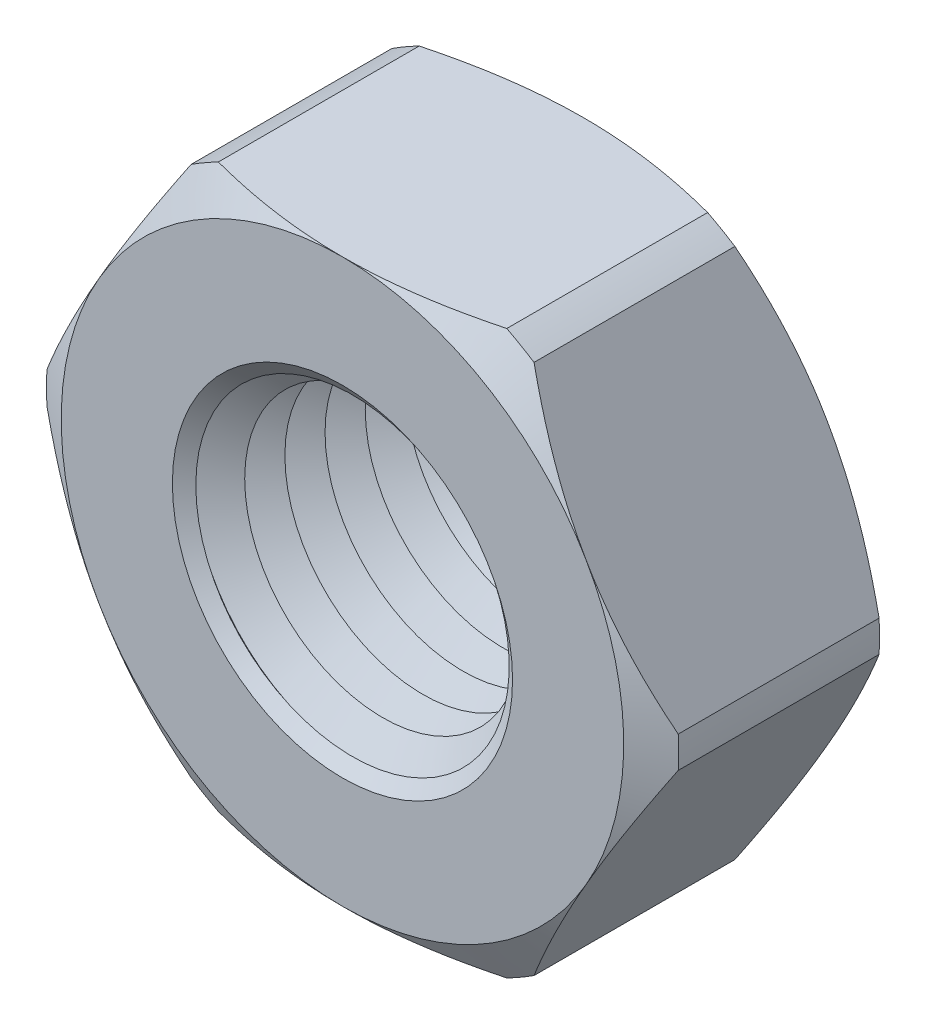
ISO-10303-21;
HEADER;
FILE_DESCRIPTION(('STEP AP214'),'2;1');
FILE_NAME('part.step','',(''),(''),'','','');
FILE_SCHEMA(('AUTOMOTIVE_DESIGN { 1 0 10303 214 1 1 1 1 }'));
ENDSEC;
DATA;
#1=APPLICATION_CONTEXT('core data for automotive mechanical design processes');
#2=APPLICATION_PROTOCOL_DEFINITION('international standard','automotive_design',2000,#1);
#3=PRODUCT_CONTEXT('',#1,'mechanical');
#4=PRODUCT('Part','Part','',(#3));
#5=PRODUCT_RELATED_PRODUCT_CATEGORY('part','',(#4));
#6=PRODUCT_DEFINITION_FORMATION('','',#4);
#7=PRODUCT_DEFINITION_CONTEXT('part definition',#1,'design');
#8=PRODUCT_DEFINITION('design','',#6,#7);
#9=PRODUCT_DEFINITION_SHAPE('','',#8);
#10=(LENGTH_UNIT() NAMED_UNIT(*) SI_UNIT(.MILLI.,.METRE.));
#11=(NAMED_UNIT(*) PLANE_ANGLE_UNIT() SI_UNIT($,.RADIAN.));
#12=(NAMED_UNIT(*) SI_UNIT($,.STERADIAN.) SOLID_ANGLE_UNIT());
#13=UNCERTAINTY_MEASURE_WITH_UNIT(LENGTH_MEASURE(1.E-05),#10,'distance_accuracy_value','');
#14=(GEOMETRIC_REPRESENTATION_CONTEXT(3) GLOBAL_UNCERTAINTY_ASSIGNED_CONTEXT((#13)) GLOBAL_UNIT_ASSIGNED_CONTEXT((#10,
#11,#12)) REPRESENTATION_CONTEXT('',''));
#15=CARTESIAN_POINT('',(0.,0.,0.));
#16=DIRECTION('',(0.,0.,1.));
#17=DIRECTION('',(1.,0.,0.));
#18=AXIS2_PLACEMENT_3D('',#15,#16,#17);
#19=CARTESIAN_POINT('',(0.,0.,0.));
#20=DIRECTION('',(0.,0.,1.));
#21=DIRECTION('',(1.,0.,0.));
#22=AXIS2_PLACEMENT_3D('',#19,#20,#21);
#23=CONICAL_SURFACE('',#22,10.5,1.0471975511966);
#24=CARTESIAN_POINT('',(6.40076904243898,-9.9135428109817,0.750755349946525));
#25=CARTESIAN_POINT('',(6.53129313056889,-9.6874684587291,0.681977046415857));
#26=CARTESIAN_POINT('',(6.66231970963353,-9.4605237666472,0.616893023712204));
#27=CARTESIAN_POINT('',(6.92537626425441,-9.00489644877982,0.495030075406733));
#28=CARTESIAN_POINT('',(7.05740654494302,-8.77621329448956,0.438253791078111));
#29=CARTESIAN_POINT('',(7.32260739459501,-8.31687194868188,0.333880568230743));
#30=CARTESIAN_POINT('',(7.45577950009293,-8.08621109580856,0.286299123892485));
#31=CARTESIAN_POINT('',(7.72292680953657,-7.62349838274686,0.201351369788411));
#32=CARTESIAN_POINT('',(7.85690193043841,-7.39144666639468,0.163984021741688));
#33=CARTESIAN_POINT('',(8.12256663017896,-6.93130190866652,0.10096362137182));
#34=CARTESIAN_POINT('',(8.25424196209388,-6.70323354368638,0.0750718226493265));
#35=CARTESIAN_POINT('',(8.51802811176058,-6.24634253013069,0.0344130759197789));
#36=CARTESIAN_POINT('',(8.65013894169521,-6.01751986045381,0.0196464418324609));
#37=CARTESIAN_POINT('',(8.914434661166,-5.55974624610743,0.00160529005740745));
#38=CARTESIAN_POINT('',(9.0466193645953,-5.33079562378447,-0.00168000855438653));
#39=CARTESIAN_POINT('',(9.31092397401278,-4.87300661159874,0.00328792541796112));
#40=CARTESIAN_POINT('',(9.44304388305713,-4.64416821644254,0.0115405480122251));
#41=CARTESIAN_POINT('',(9.76029600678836,-4.09467141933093,0.0450234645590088));
#42=CARTESIAN_POINT('',(9.94528764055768,-3.77425651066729,0.075764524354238));
#43=CARTESIAN_POINT('',(10.314150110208,-3.13536797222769,0.158247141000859));
#44=CARTESIAN_POINT('',(10.4980204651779,-2.81689517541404,0.209997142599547));
#45=CARTESIAN_POINT('',(10.8670701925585,-2.1776822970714,0.333360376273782));
#46=CARTESIAN_POINT('',(11.0522238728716,-1.85698671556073,0.405276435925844));
#47=CARTESIAN_POINT('',(11.420509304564,-1.21909763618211,0.565990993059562));
#48=CARTESIAN_POINT('',(11.603642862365,-0.901901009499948,0.654772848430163));
#49=CARTESIAN_POINT('',(11.7857644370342,-0.586457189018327,0.750755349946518));
#50=B_SPLINE_CURVE_WITH_KNOTS('',3,(#24,#25,#26,#27,#28,#29,#30,#31,#32,#33,#34,#35,#36,#37,#38,
#39,#40,#41,#42,#43,#44,#45,#46,#47,#48,#49),.UNSPECIFIED.,.F.,.F.,(4,2,2,2,2,2,2,2,2,2,2,2,4),
(0.,0.809888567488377,1.62003406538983,2.43153305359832,3.24294952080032,4.03658589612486,
4.83024466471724,5.62315799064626,6.41602939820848,7.52912447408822,8.64266741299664,
9.77392088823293,10.9040638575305),.UNSPECIFIED.);
#51=CARTESIAN_POINT('',(6.40114861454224,-9.91288537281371,0.750555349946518));
#52=VERTEX_POINT('',#51);
#53=CARTESIAN_POINT('',(9.0932667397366,-5.25,0.));
#54=VERTEX_POINT('',#53);
#55=EDGE_CURVE('E219',#52,#54,#50,.T.);
#56=ORIENTED_EDGE('',*,*,#55,.F.);
#57=CARTESIAN_POINT('',(0.,0.,0.750555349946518));
#58=DIRECTION('',(0.,0.,-1.));
#59=DIRECTION('',(-1.,0.,0.));
#60=AXIS2_PLACEMENT_3D('',#57,#58,#59);
#61=CIRCLE('',#60,11.8);
#62=CARTESIAN_POINT('',(5.38423625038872,-10.5,0.750555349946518));
#63=VERTEX_POINT('',#62);
#64=EDGE_CURVE('E179',#52,#63,#61,.T.);
#65=ORIENTED_EDGE('',*,*,#64,.T.);
#66=CARTESIAN_POINT('',(-16.0518293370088,-10.5,5.01198467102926));
#67=CARTESIAN_POINT('',(-15.8214339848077,-10.5,4.90066883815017));
#68=CARTESIAN_POINT('',(-15.5907594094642,-10.5,4.78993120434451));
#69=CARTESIAN_POINT('',(-15.1287928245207,-10.5,4.56974511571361));
#70=CARTESIAN_POINT('',(-14.8975008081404,-10.5,4.46029667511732));
#71=CARTESIAN_POINT('',(-14.202541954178,-10.5,4.13405240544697));
#72=CARTESIAN_POINT('',(-13.7378676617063,-10.5,3.91939413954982));
#73=CARTESIAN_POINT('',(-12.8026268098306,-10.5,3.49593498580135));
#74=CARTESIAN_POINT('',(-12.332041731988,-10.5,3.28717489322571));
#75=CARTESIAN_POINT('',(-11.3869949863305,-10.5,2.8786553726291));
#76=CARTESIAN_POINT('',(-10.9125335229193,-10.5,2.67889547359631));
#77=CARTESIAN_POINT('',(-9.95320898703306,-10.5,2.28845439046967));
#78=CARTESIAN_POINT('',(-9.46828943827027,-10.5,2.0979112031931));
#79=CARTESIAN_POINT('',(-8.49272283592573,-10.5,1.73181268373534));
#80=CARTESIAN_POINT('',(-8.00207515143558,-10.5,1.55625902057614));
#81=CARTESIAN_POINT('',(-7.0152819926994,-10.5,1.22487664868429));
#82=CARTESIAN_POINT('',(-6.51915083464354,-10.5,1.06900577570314));
#83=CARTESIAN_POINT('',(-5.51985436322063,-10.5,0.782065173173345));
#84=CARTESIAN_POINT('',(-5.01669133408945,-10.5,0.650987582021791));
#85=CARTESIAN_POINT('',(-4.00289296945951,-10.5,0.420020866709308));
#86=CARTESIAN_POINT('',(-3.4922553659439,-10.5,0.320141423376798));
#87=CARTESIAN_POINT('',(-2.72182819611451,-10.5,0.198736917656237));
#88=CARTESIAN_POINT('',(-2.46424255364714,-10.5,0.163001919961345));
#89=CARTESIAN_POINT('',(-1.94787163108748,-10.5,0.101706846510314));
#90=CARTESIAN_POINT('',(-1.68908646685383,-10.5,0.076145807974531));
#91=CARTESIAN_POINT('',(-1.17229421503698,-10.5,0.0358854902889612));
#92=CARTESIAN_POINT('',(-0.914292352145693,-10.5,0.0211194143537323));
#93=CARTESIAN_POINT('',(-0.397895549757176,-10.5,0.00252664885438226));
#94=CARTESIAN_POINT('',(-0.139500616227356,-10.5,-0.00130020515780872));
#95=CARTESIAN_POINT('',(0.377146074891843,-10.5,0.00207651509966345));
#96=CARTESIAN_POINT('',(0.635397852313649,-10.5,0.00927701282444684));
#97=CARTESIAN_POINT('',(1.1513738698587,-10.5,0.0345300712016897));
#98=CARTESIAN_POINT('',(1.40909808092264,-10.5,0.0525832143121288));
#99=CARTESIAN_POINT('',(2.03438758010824,-10.5,0.109173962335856));
#100=CARTESIAN_POINT('',(2.40146711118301,-10.5,0.153184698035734));
#101=CARTESIAN_POINT('',(3.13273302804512,-10.5,0.260765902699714));
#102=CARTESIAN_POINT('',(3.4969189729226,-10.5,0.324339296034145));
#103=CARTESIAN_POINT('',(4.58578040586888,-10.5,0.541213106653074));
#104=CARTESIAN_POINT('',(5.30533476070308,-10.5,0.720521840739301));
#105=CARTESIAN_POINT('',(6.38161693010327,-10.5,1.02948621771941));
#106=CARTESIAN_POINT('',(6.74397361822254,-10.5,1.14064434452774));
#107=CARTESIAN_POINT('',(7.46518653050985,-10.5,1.37399168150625));
#108=CARTESIAN_POINT('',(7.82404243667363,-10.5,1.49618188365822));
#109=CARTESIAN_POINT('',(8.53646238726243,-10.5,1.74897901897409));
#110=CARTESIAN_POINT('',(8.89004487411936,-10.5,1.87953450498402));
#111=CARTESIAN_POINT('',(9.5942041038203,-10.5,2.14817327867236));
#112=CARTESIAN_POINT('',(9.94478184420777,-10.5,2.28625394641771));
#113=CARTESIAN_POINT('',(10.2940949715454,-10.5,2.42739207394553));
#114=B_SPLINE_CURVE_WITH_KNOTS('',3,(#66,#67,#68,#69,#70,#71,#72,#73,#74,#75,#76,#77,#78,#79,
#80,#81,#82,#83,#84,#85,#86,#87,#88,#89,#90,#91,#92,#93,#94,#95,#96,#97,#98,#99,#100,#101,#102,
#103,#104,#105,#106,#107,#108,#109,#110,#111,#112,#113),.UNSPECIFIED.,.F.,.F.,(4,2,2,2,2,2,2,2,
2,2,2,2,2,2,2,2,2,2,2,2,2,2,2,4),(0.,0.767630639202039,1.53526974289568,3.07079912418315,
4.61516115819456,6.1594422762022,7.72228668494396,9.28530488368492,10.844915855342,
12.4040314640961,13.9636303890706,14.7436187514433,15.5235332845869,16.2985800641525,
17.0736151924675,17.8484341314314,18.6232946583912,19.7317896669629,20.8404504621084,
23.0620493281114,24.1990308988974,25.3361148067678,26.4667751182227,27.5970442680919),.UNSPECIFIED.);
#115=CARTESIAN_POINT('',(0.,-10.5,0.));
#116=VERTEX_POINT('',#115);
#117=EDGE_CURVE('E161',#116,#63,#114,.T.);
#118=ORIENTED_EDGE('',*,*,#117,.F.);
#119=CARTESIAN_POINT('',(0.,0.,0.));
#120=DIRECTION('',(0.,0.,-1.));
#121=DIRECTION('',(-1.,0.,0.));
#122=AXIS2_PLACEMENT_3D('',#119,#120,#121);
#123=CIRCLE('',#122,10.5);
#124=EDGE_CURVE('E176',#54,#116,#123,.T.);
#125=ORIENTED_EDGE('',*,*,#124,.F.);
#126=EDGE_LOOP('',(#56,#65,#118,#125));
#127=FACE_BOUND('',#126,.T.);
#128=ADVANCED_FACE('F34',(#127),#23,.T.);
#129=CARTESIAN_POINT('',(11.785384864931,-0.587114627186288,0.750555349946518));
#130=VERTEX_POINT('',#129);
#131=EDGE_CURVE('E215',#54,#130,#50,.T.);
#132=ORIENTED_EDGE('',*,*,#131,.F.);
#133=CARTESIAN_POINT('',(9.09326673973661,5.25,0.));
#134=VERTEX_POINT('',#133);
#135=EDGE_CURVE('E192',#134,#54,#123,.T.);
#136=ORIENTED_EDGE('',*,*,#135,.F.);
#137=CARTESIAN_POINT('',(11.7857644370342,0.586457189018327,0.750755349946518));
#138=CARTESIAN_POINT('',(11.6552403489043,0.812531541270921,0.68197704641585));
#139=CARTESIAN_POINT('',(11.5242137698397,1.03947623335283,0.616893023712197));
#140=CARTESIAN_POINT('',(11.2611572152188,1.49510355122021,0.495030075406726));
#141=CARTESIAN_POINT('',(11.1291269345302,1.72378670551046,0.438253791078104));
#142=CARTESIAN_POINT('',(10.8639260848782,2.18312805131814,0.333880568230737));
#143=CARTESIAN_POINT('',(10.7307539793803,2.41378890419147,0.286299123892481));
#144=CARTESIAN_POINT('',(10.4636066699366,2.87650161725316,0.201351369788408));
#145=CARTESIAN_POINT('',(10.3296315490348,3.10855333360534,0.163984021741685));
#146=CARTESIAN_POINT('',(10.0639668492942,3.56869809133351,0.100963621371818));
#147=CARTESIAN_POINT('',(9.93229151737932,3.79676645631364,0.0750718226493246));
#148=CARTESIAN_POINT('',(9.66850536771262,4.25365746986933,0.0344130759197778));
#149=CARTESIAN_POINT('',(9.53639453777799,4.48248013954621,0.0196464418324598));
#150=CARTESIAN_POINT('',(9.2720988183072,4.94025375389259,0.00160529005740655));
#151=CARTESIAN_POINT('',(9.1399141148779,5.16920437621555,-0.00168000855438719));
#152=CARTESIAN_POINT('',(8.87560950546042,5.62699338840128,0.00328792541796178));
#153=CARTESIAN_POINT('',(8.74348959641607,5.85583178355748,0.0115405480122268));
#154=CARTESIAN_POINT('',(8.42623747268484,6.40532858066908,0.045023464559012));
#155=CARTESIAN_POINT('',(8.24124583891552,6.72574348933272,0.0757645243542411));
#156=CARTESIAN_POINT('',(7.87238336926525,7.36463202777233,0.158247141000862));
#157=CARTESIAN_POINT('',(7.68851301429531,7.68310482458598,0.209997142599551));
#158=CARTESIAN_POINT('',(7.31946328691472,8.32231770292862,0.333360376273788));
#159=CARTESIAN_POINT('',(7.13430960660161,8.64301328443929,0.405276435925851));
#160=CARTESIAN_POINT('',(6.76602417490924,9.28090236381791,0.56599099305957));
#161=CARTESIAN_POINT('',(6.58289061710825,9.59809899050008,0.654772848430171));
#162=CARTESIAN_POINT('',(6.40076904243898,9.9135428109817,0.750755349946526));
#163=B_SPLINE_CURVE_WITH_KNOTS('',3,(#137,#138,#139,#140,#141,#142,#143,#144,#145,#146,#147,
#148,#149,#150,#151,#152,#153,#154,#155,#156,#157,#158,#159,#160,#161,#162),.UNSPECIFIED.,.F.,
.F.,(4,2,2,2,2,2,2,2,2,2,2,2,4),(0.,0.809888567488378,1.62003406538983,2.43153305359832,
3.24294952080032,4.03658589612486,4.83024466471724,5.62315799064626,6.41602939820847,
7.52912447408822,8.64266741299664,9.77392088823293,10.9040638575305),.UNSPECIFIED.);
#164=CARTESIAN_POINT('',(11.785384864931,0.587114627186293,0.750555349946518));
#165=VERTEX_POINT('',#164);
#166=EDGE_CURVE('E206',#165,#134,#163,.T.);
#167=ORIENTED_EDGE('',*,*,#166,.F.);
#168=EDGE_CURVE('E216',#165,#130,#61,.T.);
#169=ORIENTED_EDGE('',*,*,#168,.T.);
#170=EDGE_LOOP('',(#132,#136,#167,#169));
#171=FACE_BOUND('',#170,.T.);
#172=ADVANCED_FACE('F212',(#171),#23,.T.);
#173=CARTESIAN_POINT('',(6.40114861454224,9.91288537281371,0.750555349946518));
#174=VERTEX_POINT('',#173);
#175=EDGE_CURVE('E202',#134,#174,#163,.T.);
#176=ORIENTED_EDGE('',*,*,#175,.F.);
#177=CARTESIAN_POINT('',(0.,10.5,0.));
#178=VERTEX_POINT('',#177);
#179=EDGE_CURVE('E42',#178,#134,#123,.T.);
#180=ORIENTED_EDGE('',*,*,#179,.F.);
#181=CARTESIAN_POINT('',(-16.0518293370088,10.5,5.01198467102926));
#182=CARTESIAN_POINT('',(-15.8214339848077,10.5,4.90066883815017));
#183=CARTESIAN_POINT('',(-15.5907594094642,10.5,4.78993120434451));
#184=CARTESIAN_POINT('',(-15.1287928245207,10.5,4.56974511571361));
#185=CARTESIAN_POINT('',(-14.8975008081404,10.5,4.46029667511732));
#186=CARTESIAN_POINT('',(-14.202541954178,10.5,4.13405240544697));
#187=CARTESIAN_POINT('',(-13.7378676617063,10.5,3.91939413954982));
#188=CARTESIAN_POINT('',(-12.8026268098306,10.5,3.49593498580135));
#189=CARTESIAN_POINT('',(-12.3320417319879,10.5,3.28717489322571));
#190=CARTESIAN_POINT('',(-11.3869949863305,10.5,2.8786553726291));
#191=CARTESIAN_POINT('',(-10.9125335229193,10.5,2.67889547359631));
#192=CARTESIAN_POINT('',(-9.95320898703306,10.5,2.28845439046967));
#193=CARTESIAN_POINT('',(-9.46828943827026,10.5,2.0979112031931));
#194=CARTESIAN_POINT('',(-8.49272283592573,10.5,1.73181268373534));
#195=CARTESIAN_POINT('',(-8.00207515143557,10.5,1.55625902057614));
#196=CARTESIAN_POINT('',(-7.01528199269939,10.5,1.22487664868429));
#197=CARTESIAN_POINT('',(-6.51915083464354,10.5,1.06900577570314));
#198=CARTESIAN_POINT('',(-5.51985436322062,10.5,0.782065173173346));
#199=CARTESIAN_POINT('',(-5.01669133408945,10.5,0.650987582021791));
#200=CARTESIAN_POINT('',(-4.00289296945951,10.5,0.420020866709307));
#201=CARTESIAN_POINT('',(-3.4922553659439,10.5,0.320141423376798));
#202=CARTESIAN_POINT('',(-2.72182819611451,10.5,0.198736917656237));
#203=CARTESIAN_POINT('',(-2.46424255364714,10.5,0.163001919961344));
#204=CARTESIAN_POINT('',(-1.94787163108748,10.5,0.101706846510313));
#205=CARTESIAN_POINT('',(-1.68908646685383,10.5,0.0761458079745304));
#206=CARTESIAN_POINT('',(-1.17229421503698,10.5,0.0358854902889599));
#207=CARTESIAN_POINT('',(-0.914292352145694,10.5,0.0211194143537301));
#208=CARTESIAN_POINT('',(-0.397895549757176,10.5,0.00252664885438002));
#209=CARTESIAN_POINT('',(-0.139500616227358,10.5,-0.00130020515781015));
#210=CARTESIAN_POINT('',(0.377146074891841,10.5,0.00207651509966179));
#211=CARTESIAN_POINT('',(0.635397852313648,10.5,0.00927701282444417));
#212=CARTESIAN_POINT('',(1.1513738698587,10.5,0.0345300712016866));
#213=CARTESIAN_POINT('',(1.40909808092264,10.5,0.0525832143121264));
#214=CARTESIAN_POINT('',(2.03438758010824,10.5,0.109173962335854));
#215=CARTESIAN_POINT('',(2.40146711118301,10.5,0.153184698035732));
#216=CARTESIAN_POINT('',(3.13273302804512,10.5,0.260765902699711));
#217=CARTESIAN_POINT('',(3.4969189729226,10.5,0.324339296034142));
#218=CARTESIAN_POINT('',(4.58578040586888,10.5,0.541213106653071));
#219=CARTESIAN_POINT('',(5.30533476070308,10.5,0.720521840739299));
#220=CARTESIAN_POINT('',(6.38161693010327,10.5,1.02948621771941));
#221=CARTESIAN_POINT('',(6.74397361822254,10.5,1.14064434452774));
#222=CARTESIAN_POINT('',(7.46518653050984,10.5,1.37399168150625));
#223=CARTESIAN_POINT('',(7.82404243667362,10.5,1.49618188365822));
#224=CARTESIAN_POINT('',(8.53646238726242,10.5,1.74897901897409));
#225=CARTESIAN_POINT('',(8.89004487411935,10.5,1.87953450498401));
#226=CARTESIAN_POINT('',(9.59420410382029,10.5,2.14817327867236));
#227=CARTESIAN_POINT('',(9.94478184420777,10.5,2.2862539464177));
#228=CARTESIAN_POINT('',(10.2940949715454,10.5,2.42739207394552));
#229=B_SPLINE_CURVE_WITH_KNOTS('',3,(#181,#182,#183,#184,#185,#186,#187,#188,#189,#190,#191,
#192,#193,#194,#195,#196,#197,#198,#199,#200,#201,#202,#203,#204,#205,#206,#207,#208,#209,#210,
#211,#212,#213,#214,#215,#216,#217,#218,#219,#220,#221,#222,#223,#224,#225,#226,#227,#228),
.UNSPECIFIED.,.F.,.F.,(4,2,2,2,2,2,2,2,2,2,2,2,2,2,2,2,2,2,2,2,2,2,2,4),(0.,0.767630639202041,
1.53526974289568,3.07079912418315,4.61516115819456,6.1594422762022,7.72228668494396,
9.28530488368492,10.844915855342,12.4040314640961,13.9636303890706,14.7436187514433,
15.5235332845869,16.2985800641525,17.0736151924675,17.8484341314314,18.6232946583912,
19.7317896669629,20.8404504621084,23.0620493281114,24.1990308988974,25.3361148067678,
26.4667751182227,27.5970442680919),.UNSPECIFIED.);
#230=CARTESIAN_POINT('',(5.38423625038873,10.5,0.750555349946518));
#231=VERTEX_POINT('',#230);
#232=EDGE_CURVE('E200',#231,#178,#229,.F.);
#233=ORIENTED_EDGE('',*,*,#232,.F.);
#234=EDGE_CURVE('E203',#231,#174,#61,.T.);
#235=ORIENTED_EDGE('',*,*,#234,.T.);
#236=EDGE_LOOP('',(#176,#180,#233,#235));
#237=FACE_BOUND('',#236,.T.);
#238=ADVANCED_FACE('F198',(#237),#23,.T.);
#239=CARTESIAN_POINT('',(-5.38423625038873,10.5,0.750555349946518));
#240=VERTEX_POINT('',#239);
#241=EDGE_CURVE('E307',#178,#240,#229,.F.);
#242=ORIENTED_EDGE('',*,*,#241,.F.);
#243=CARTESIAN_POINT('',(-9.09326673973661,5.25,0.));
#244=VERTEX_POINT('',#243);
#245=EDGE_CURVE('E12',#244,#178,#123,.T.);
#246=ORIENTED_EDGE('',*,*,#245,.F.);
#247=CARTESIAN_POINT('',(-6.40076904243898,9.91354281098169,0.750755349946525));
#248=CARTESIAN_POINT('',(-6.53129313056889,9.6874684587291,0.681977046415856));
#249=CARTESIAN_POINT('',(-6.66231970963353,9.46052376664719,0.616893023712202));
#250=CARTESIAN_POINT('',(-6.92537626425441,9.00489644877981,0.495030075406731));
#251=CARTESIAN_POINT('',(-7.05740654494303,8.77621329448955,0.438253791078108));
#252=CARTESIAN_POINT('',(-7.32260739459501,8.31687194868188,0.333880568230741));
#253=CARTESIAN_POINT('',(-7.45577950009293,8.08621109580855,0.286299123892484));
#254=CARTESIAN_POINT('',(-7.72292680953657,7.62349838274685,0.201351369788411));
#255=CARTESIAN_POINT('',(-7.85690193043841,7.39144666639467,0.163984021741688));
#256=CARTESIAN_POINT('',(-8.12256663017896,6.93130190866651,0.100963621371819));
#257=CARTESIAN_POINT('',(-8.25424196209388,6.70323354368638,0.0750718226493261));
#258=CARTESIAN_POINT('',(-8.51802811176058,6.24634253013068,0.0344130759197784));
#259=CARTESIAN_POINT('',(-8.65013894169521,6.01751986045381,0.0196464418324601));
#260=CARTESIAN_POINT('',(-8.91443466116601,5.55974624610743,0.00160529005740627));
#261=CARTESIAN_POINT('',(-9.0466193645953,5.33079562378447,-0.00168000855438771));
#262=CARTESIAN_POINT('',(-9.31092397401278,4.87300661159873,0.0032879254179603));
#263=CARTESIAN_POINT('',(-9.44304388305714,4.64416821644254,0.0115405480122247));
#264=CARTESIAN_POINT('',(-9.76029600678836,4.09467141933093,0.0450234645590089));
#265=CARTESIAN_POINT('',(-9.94528764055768,3.77425651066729,0.075764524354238));
#266=CARTESIAN_POINT('',(-10.314150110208,3.13536797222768,0.158247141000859));
#267=CARTESIAN_POINT('',(-10.4980204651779,2.81689517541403,0.209997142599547));
#268=CARTESIAN_POINT('',(-10.8670701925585,2.1776822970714,0.333360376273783));
#269=CARTESIAN_POINT('',(-11.0522238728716,1.85698671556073,0.405276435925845));
#270=CARTESIAN_POINT('',(-11.420509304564,1.2190976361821,0.565990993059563));
#271=CARTESIAN_POINT('',(-11.603642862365,0.90190100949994,0.654772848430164));
#272=CARTESIAN_POINT('',(-11.7857644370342,0.58645718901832,0.750755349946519));
#273=B_SPLINE_CURVE_WITH_KNOTS('',3,(#247,#248,#249,#250,#251,#252,#253,#254,#255,#256,#257,
#258,#259,#260,#261,#262,#263,#264,#265,#266,#267,#268,#269,#270,#271,#272),.UNSPECIFIED.,.F.,
.F.,(4,2,2,2,2,2,2,2,2,2,2,2,4),(0.,0.80988856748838,1.62003406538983,2.43153305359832,
3.24294952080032,4.03658589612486,4.83024466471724,5.62315799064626,6.41602939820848,
7.52912447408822,8.64266741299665,9.77392088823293,10.9040638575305),.UNSPECIFIED.);
#274=CARTESIAN_POINT('',(-6.40114861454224,9.91288537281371,0.750555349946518));
#275=VERTEX_POINT('',#274);
#276=EDGE_CURVE('E354',#275,#244,#273,.T.);
#277=ORIENTED_EDGE('',*,*,#276,.F.);
#278=EDGE_CURVE('E343',#275,#240,#61,.T.);
#279=ORIENTED_EDGE('',*,*,#278,.T.);
#280=EDGE_LOOP('',(#242,#246,#277,#279));
#281=FACE_BOUND('',#280,.T.);
#282=ADVANCED_FACE('F353',(#281),#23,.T.);
#283=CARTESIAN_POINT('',(-11.785384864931,0.58711462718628,0.750555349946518));
#284=VERTEX_POINT('',#283);
#285=EDGE_CURVE('E360',#244,#284,#273,.T.);
#286=ORIENTED_EDGE('',*,*,#285,.F.);
#287=CARTESIAN_POINT('',(-9.0932667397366,-5.25,0.));
#288=VERTEX_POINT('',#287);
#289=EDGE_CURVE('E43',#288,#244,#123,.T.);
#290=ORIENTED_EDGE('',*,*,#289,.F.);
#291=CARTESIAN_POINT('',(-11.7857644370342,-0.586457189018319,0.750755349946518));
#292=CARTESIAN_POINT('',(-11.6552403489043,-0.812531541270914,0.68197704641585));
#293=CARTESIAN_POINT('',(-11.5242137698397,-1.03947623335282,0.616893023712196));
#294=CARTESIAN_POINT('',(-11.2611572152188,-1.4951035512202,0.495030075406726));
#295=CARTESIAN_POINT('',(-11.1291269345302,-1.72378670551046,0.438253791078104));
#296=CARTESIAN_POINT('',(-10.8639260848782,-2.18312805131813,0.333880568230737));
#297=CARTESIAN_POINT('',(-10.7307539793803,-2.41378890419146,0.28629912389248));
#298=CARTESIAN_POINT('',(-10.4636066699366,-2.87650161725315,0.201351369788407));
#299=CARTESIAN_POINT('',(-10.3296315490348,-3.10855333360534,0.163984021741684));
#300=CARTESIAN_POINT('',(-10.0639668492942,-3.5686980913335,0.100963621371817));
#301=CARTESIAN_POINT('',(-9.93229151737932,-3.79676645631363,0.075071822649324));
#302=CARTESIAN_POINT('',(-9.66850536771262,-4.25365746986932,0.0344130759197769));
#303=CARTESIAN_POINT('',(-9.53639453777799,-4.4824801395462,0.0196464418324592));
#304=CARTESIAN_POINT('',(-9.2720988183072,-4.94025375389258,0.00160529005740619));
#305=CARTESIAN_POINT('',(-9.13991411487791,-5.16920437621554,-0.00168000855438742));
#306=CARTESIAN_POINT('',(-8.87560950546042,-5.62699338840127,0.00328792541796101));
#307=CARTESIAN_POINT('',(-8.74348959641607,-5.85583178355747,0.0115405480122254));
#308=CARTESIAN_POINT('',(-8.42623747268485,-6.40532858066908,0.0450234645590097));
#309=CARTESIAN_POINT('',(-8.24124583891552,-6.72574348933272,0.075764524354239));
#310=CARTESIAN_POINT('',(-7.87238336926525,-7.36463202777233,0.15824714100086));
#311=CARTESIAN_POINT('',(-7.68851301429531,-7.68310482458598,0.209997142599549));
#312=CARTESIAN_POINT('',(-7.31946328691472,-8.32231770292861,0.333360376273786));
#313=CARTESIAN_POINT('',(-7.13430960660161,-8.64301328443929,0.405276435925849));
#314=CARTESIAN_POINT('',(-6.76602417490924,-9.28090236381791,0.565990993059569));
#315=CARTESIAN_POINT('',(-6.58289061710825,-9.59809899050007,0.654772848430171));
#316=CARTESIAN_POINT('',(-6.40076904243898,-9.9135428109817,0.750755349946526));
#317=B_SPLINE_CURVE_WITH_KNOTS('',3,(#291,#292,#293,#294,#295,#296,#297,#298,#299,#300,#301,
#302,#303,#304,#305,#306,#307,#308,#309,#310,#311,#312,#313,#314,#315,#316),.UNSPECIFIED.,.F.,
.F.,(4,2,2,2,2,2,2,2,2,2,2,2,4),(0.,0.809888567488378,1.62003406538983,2.43153305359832,
3.24294952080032,4.03658589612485,4.83024466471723,5.62315799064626,6.41602939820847,
7.52912447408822,8.64266741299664,9.77392088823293,10.9040638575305),.UNSPECIFIED.);
#318=CARTESIAN_POINT('',(-11.785384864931,-0.587114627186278,0.750555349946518));
#319=VERTEX_POINT('',#318);
#320=EDGE_CURVE('E409',#319,#288,#317,.T.);
#321=ORIENTED_EDGE('',*,*,#320,.F.);
#322=EDGE_CURVE('E332',#319,#284,#61,.T.);
#323=ORIENTED_EDGE('',*,*,#322,.T.);
#324=EDGE_LOOP('',(#286,#290,#321,#323));
#325=FACE_BOUND('',#324,.T.);
#326=ADVANCED_FACE('F385',(#325),#23,.T.);
#327=CARTESIAN_POINT('',(0.,0.,0.));
#328=DIRECTION('',(0.,0.,-1.));
#329=DIRECTION('',(-1.,0.,0.));
#330=AXIS2_PLACEMENT_3D('',#327,#328,#329);
#331=CYLINDRICAL_SURFACE('',#330,11.8);
#332=DIRECTION('',(0.,0.,-1.));
#333=VECTOR('',#332,1.);
#334=CARTESIAN_POINT('',(11.785384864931,-0.587114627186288,0.));
#335=LINE('',#334,#333);
#336=CARTESIAN_POINT('',(11.785384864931,-0.587114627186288,8.24944465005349));
#337=VERTEX_POINT('',#336);
#338=EDGE_CURVE('E220',#130,#337,#335,.F.);
#339=ORIENTED_EDGE('',*,*,#338,.F.);
#340=ORIENTED_EDGE('',*,*,#168,.F.);
#341=DIRECTION('',(0.,0.,-1.));
#342=VECTOR('',#341,1.);
#343=CARTESIAN_POINT('',(11.785384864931,0.587114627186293,0.));
#344=LINE('',#343,#342);
#345=CARTESIAN_POINT('',(11.785384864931,0.587114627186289,8.24944465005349));
#346=VERTEX_POINT('',#345);
#347=EDGE_CURVE('E312',#346,#165,#344,.T.);
#348=ORIENTED_EDGE('',*,*,#347,.F.);
#349=CARTESIAN_POINT('',(0.,0.,8.24944465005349));
#350=DIRECTION('',(0.,0.,-1.));
#351=DIRECTION('',(-1.,0.,0.));
#352=AXIS2_PLACEMENT_3D('',#349,#350,#351);
#353=CIRCLE('',#352,11.8);
#354=EDGE_CURVE('E329',#346,#337,#353,.T.);
#355=ORIENTED_EDGE('',*,*,#354,.T.);
#356=EDGE_LOOP('',(#339,#340,#348,#355));
#357=FACE_BOUND('',#356,.T.);
#358=ADVANCED_FACE('F391',(#357),#331,.T.);
#359=DIRECTION('',(0.,0.,-1.));
#360=VECTOR('',#359,1.);
#361=CARTESIAN_POINT('',(6.40114861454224,9.91288537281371,0.));
#362=LINE('',#361,#360);
#363=CARTESIAN_POINT('',(6.40114861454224,9.91288537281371,8.24944465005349));
#364=VERTEX_POINT('',#363);
#365=EDGE_CURVE('E207',#174,#364,#362,.F.);
#366=ORIENTED_EDGE('',*,*,#365,.F.);
#367=ORIENTED_EDGE('',*,*,#234,.F.);
#368=DIRECTION('',(0.,0.,-1.));
#369=VECTOR('',#368,1.);
#370=CARTESIAN_POINT('',(5.38423625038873,10.5,0.));
#371=LINE('',#370,#369);
#372=CARTESIAN_POINT('',(5.38423625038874,10.5,8.24944465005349));
#373=VERTEX_POINT('',#372);
#374=EDGE_CURVE('E327',#373,#231,#371,.T.);
#375=ORIENTED_EDGE('',*,*,#374,.F.);
#376=EDGE_CURVE('E322',#373,#364,#353,.T.);
#377=ORIENTED_EDGE('',*,*,#376,.T.);
#378=EDGE_LOOP('',(#366,#367,#375,#377));
#379=FACE_BOUND('',#378,.T.);
#380=ADVANCED_FACE('F326',(#379),#331,.T.);
#381=DIRECTION('',(0.,0.,-1.));
#382=VECTOR('',#381,1.);
#383=CARTESIAN_POINT('',(-5.38423625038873,10.5,0.));
#384=LINE('',#383,#382);
#385=CARTESIAN_POINT('',(-5.38423625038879,10.5,8.24944465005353));
#386=VERTEX_POINT('',#385);
#387=EDGE_CURVE('E357',#240,#386,#384,.F.);
#388=ORIENTED_EDGE('',*,*,#387,.F.);
#389=ORIENTED_EDGE('',*,*,#278,.F.);
#390=DIRECTION('',(0.,0.,-1.));
#391=VECTOR('',#390,1.);
#392=CARTESIAN_POINT('',(-6.40114861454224,9.91288537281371,0.));
#393=LINE('',#392,#391);
#394=CARTESIAN_POINT('',(-6.40114861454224,9.91288537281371,8.24944465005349));
#395=VERTEX_POINT('',#394);
#396=EDGE_CURVE('E405',#395,#275,#393,.T.);
#397=ORIENTED_EDGE('',*,*,#396,.F.);
#398=EDGE_CURVE('E328',#395,#386,#353,.T.);
#399=ORIENTED_EDGE('',*,*,#398,.T.);
#400=EDGE_LOOP('',(#388,#389,#397,#399));
#401=FACE_BOUND('',#400,.T.);
#402=ADVANCED_FACE('F634',(#401),#331,.T.);
#403=DIRECTION('',(0.,0.,-1.));
#404=VECTOR('',#403,1.);
#405=CARTESIAN_POINT('',(-11.785384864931,0.58711462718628,0.));
#406=LINE('',#405,#404);
#407=CARTESIAN_POINT('',(-11.785384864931,0.587114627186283,8.24944465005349));
#408=VERTEX_POINT('',#407);
#409=EDGE_CURVE('E362',#284,#408,#406,.F.);
#410=ORIENTED_EDGE('',*,*,#409,.F.);
#411=ORIENTED_EDGE('',*,*,#322,.F.);
#412=DIRECTION('',(0.,0.,-1.));
#413=VECTOR('',#412,1.);
#414=CARTESIAN_POINT('',(-11.785384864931,-0.587114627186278,0.));
#415=LINE('',#414,#413);
#416=CARTESIAN_POINT('',(-11.785384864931,-0.587114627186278,8.24944465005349));
#417=VERTEX_POINT('',#416);
#418=EDGE_CURVE('E415',#417,#319,#415,.T.);
#419=ORIENTED_EDGE('',*,*,#418,.F.);
#420=EDGE_CURVE('E333',#417,#408,#353,.T.);
#421=ORIENTED_EDGE('',*,*,#420,.T.);
#422=EDGE_LOOP('',(#410,#411,#419,#421));
#423=FACE_BOUND('',#422,.T.);
#424=ADVANCED_FACE('F402',(#423),#331,.T.);
#425=DIRECTION('',(0.,0.,-1.));
#426=VECTOR('',#425,1.);
#427=CARTESIAN_POINT('',(-6.40114861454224,-9.91288537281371,0.));
#428=LINE('',#427,#426);
#429=CARTESIAN_POINT('',(-6.40114861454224,-9.91288537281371,0.750555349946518));
#430=VERTEX_POINT('',#429);
#431=CARTESIAN_POINT('',(-6.40114861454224,-9.91288537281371,8.24944465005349));
#432=VERTEX_POINT('',#431);
#433=EDGE_CURVE('E410',#430,#432,#428,.F.);
#434=ORIENTED_EDGE('',*,*,#433,.F.);
#435=CARTESIAN_POINT('',(-5.38423625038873,-10.5,0.750555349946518));
#436=VERTEX_POINT('',#435);
#437=EDGE_CURVE('E342',#436,#430,#61,.T.);
#438=ORIENTED_EDGE('',*,*,#437,.F.);
#439=DIRECTION('',(0.,0.,-1.));
#440=VECTOR('',#439,1.);
#441=CARTESIAN_POINT('',(-5.38423625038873,-10.5,0.));
#442=LINE('',#441,#440);
#443=CARTESIAN_POINT('',(-5.38423625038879,-10.5,8.24944465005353));
#444=VERTEX_POINT('',#443);
#445=EDGE_CURVE('E164',#444,#436,#442,.T.);
#446=ORIENTED_EDGE('',*,*,#445,.F.);
#447=EDGE_CURVE('E338',#444,#432,#353,.T.);
#448=ORIENTED_EDGE('',*,*,#447,.T.);
#449=EDGE_LOOP('',(#434,#438,#446,#448));
#450=FACE_BOUND('',#449,.T.);
#451=ADVANCED_FACE('F392',(#450),#331,.T.);
#452=CARTESIAN_POINT('',(0.,0.,8.24944465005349));
#453=DIRECTION('',(0.,0.,-1.));
#454=DIRECTION('',(-1.,0.,0.));
#455=AXIS2_PLACEMENT_3D('',#452,#453,#454);
#456=CONICAL_SURFACE('',#455,11.8,1.0471975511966);
#457=CARTESIAN_POINT('',(11.7857644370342,-0.586457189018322,8.24924465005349));
#458=CARTESIAN_POINT('',(11.6552403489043,-0.812531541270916,8.31802295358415));
#459=CARTESIAN_POINT('',(11.5242137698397,-1.03947623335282,8.38310697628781));
#460=CARTESIAN_POINT('',(11.2611572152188,-1.4951035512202,8.50496992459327));
#461=CARTESIAN_POINT('',(11.1291269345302,-1.72378670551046,8.5617462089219));
#462=CARTESIAN_POINT('',(10.8639260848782,-2.18312805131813,8.66611943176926));
#463=CARTESIAN_POINT('',(10.7307539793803,-2.41378890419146,8.71370087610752));
#464=CARTESIAN_POINT('',(10.4636066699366,-2.87650161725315,8.79864863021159));
#465=CARTESIAN_POINT('',(10.3296315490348,-3.10855333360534,8.83601597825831));
#466=CARTESIAN_POINT('',(10.0639668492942,-3.5686980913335,8.89903637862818));
#467=CARTESIAN_POINT('',(9.93229151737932,-3.79676645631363,8.92492817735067));
#468=CARTESIAN_POINT('',(9.66850536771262,-4.25365746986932,8.96558692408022));
#469=CARTESIAN_POINT('',(9.53639453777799,-4.48248013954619,8.98035355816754));
#470=CARTESIAN_POINT('',(9.2720988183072,-4.94025375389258,8.99839470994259));
#471=CARTESIAN_POINT('',(9.13991411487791,-5.16920437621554,9.00168000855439));
#472=CARTESIAN_POINT('',(8.87560950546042,-5.62699338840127,8.99671207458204));
#473=CARTESIAN_POINT('',(8.74348959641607,-5.85583178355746,8.98845945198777));
#474=CARTESIAN_POINT('',(8.42623747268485,-6.40532858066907,8.95497653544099));
#475=CARTESIAN_POINT('',(8.24124583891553,-6.72574348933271,8.92423547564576));
#476=CARTESIAN_POINT('',(7.87238336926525,-7.36463202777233,8.84175285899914));
#477=CARTESIAN_POINT('',(7.68851301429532,-7.68310482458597,8.79000285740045));
#478=CARTESIAN_POINT('',(7.31946328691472,-8.32231770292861,8.66663962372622));
#479=CARTESIAN_POINT('',(7.13430960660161,-8.64301328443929,8.59472356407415));
#480=CARTESIAN_POINT('',(6.76602417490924,-9.28090236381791,8.43400900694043));
#481=CARTESIAN_POINT('',(6.58289061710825,-9.59809899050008,8.34522715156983));
#482=CARTESIAN_POINT('',(6.40076904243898,-9.9135428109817,8.24924465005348));
#483=B_SPLINE_CURVE_WITH_KNOTS('',3,(#457,#458,#459,#460,#461,#462,#463,#464,#465,#466,#467,
#468,#469,#470,#471,#472,#473,#474,#475,#476,#477,#478,#479,#480,#481,#482),.UNSPECIFIED.,.F.,
.F.,(4,2,2,2,2,2,2,2,2,2,2,2,4),(0.,0.809888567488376,1.62003406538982,2.43153305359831,
3.24294952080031,4.03658589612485,4.83024466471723,5.62315799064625,6.41602939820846,
7.52912447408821,8.64266741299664,9.77392088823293,10.9040638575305),.UNSPECIFIED.);
#484=CARTESIAN_POINT('',(9.09326673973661,-5.25,9.));
#485=VERTEX_POINT('',#484);
#486=EDGE_CURVE('E251',#337,#485,#483,.T.);
#487=ORIENTED_EDGE('',*,*,#486,.F.);
#488=ORIENTED_EDGE('',*,*,#354,.F.);
#489=CARTESIAN_POINT('',(6.40076904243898,9.9135428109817,8.24924465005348));
#490=CARTESIAN_POINT('',(6.53129313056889,9.6874684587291,8.31802295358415));
#491=CARTESIAN_POINT('',(6.66231970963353,9.4605237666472,8.3831069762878));
#492=CARTESIAN_POINT('',(6.92537626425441,9.00489644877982,8.50496992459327));
#493=CARTESIAN_POINT('',(7.05740654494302,8.77621329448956,8.56174620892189));
#494=CARTESIAN_POINT('',(7.32260739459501,8.31687194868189,8.66611943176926));
#495=CARTESIAN_POINT('',(7.45577950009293,8.08621109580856,8.71370087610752));
#496=CARTESIAN_POINT('',(7.72292680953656,7.62349838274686,8.79864863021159));
#497=CARTESIAN_POINT('',(7.85690193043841,7.39144666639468,8.83601597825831));
#498=CARTESIAN_POINT('',(8.12256663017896,6.93130190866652,8.89903637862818));
#499=CARTESIAN_POINT('',(8.25424196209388,6.70323354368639,8.92492817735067));
#500=CARTESIAN_POINT('',(8.51802811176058,6.24634253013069,8.96558692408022));
#501=CARTESIAN_POINT('',(8.65013894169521,6.01751986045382,8.98035355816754));
#502=CARTESIAN_POINT('',(8.914434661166,5.55974624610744,8.99839470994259));
#503=CARTESIAN_POINT('',(9.04661936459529,5.33079562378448,9.00168000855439));
#504=CARTESIAN_POINT('',(9.31092397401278,4.87300661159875,8.99671207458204));
#505=CARTESIAN_POINT('',(9.44304388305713,4.64416821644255,8.98845945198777));
#506=CARTESIAN_POINT('',(9.76029600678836,4.09467141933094,8.95497653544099));
#507=CARTESIAN_POINT('',(9.94528764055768,3.7742565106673,8.92423547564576));
#508=CARTESIAN_POINT('',(10.314150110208,3.13536797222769,8.84175285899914));
#509=CARTESIAN_POINT('',(10.4980204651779,2.81689517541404,8.79000285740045));
#510=CARTESIAN_POINT('',(10.8670701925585,2.17768229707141,8.66663962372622));
#511=CARTESIAN_POINT('',(11.0522238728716,1.85698671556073,8.59472356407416));
#512=CARTESIAN_POINT('',(11.420509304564,1.21909763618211,8.43400900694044));
#513=CARTESIAN_POINT('',(11.603642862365,0.901901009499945,8.34522715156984));
#514=CARTESIAN_POINT('',(11.7857644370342,0.586457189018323,8.24924465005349));
#515=B_SPLINE_CURVE_WITH_KNOTS('',3,(#489,#490,#491,#492,#493,#494,#495,#496,#497,#498,#499,
#500,#501,#502,#503,#504,#505,#506,#507,#508,#509,#510,#511,#512,#513,#514),.UNSPECIFIED.,.F.,
.F.,(4,2,2,2,2,2,2,2,2,2,2,2,4),(0.,0.809888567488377,1.62003406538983,2.43153305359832,
3.24294952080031,4.03658589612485,4.83024466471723,5.62315799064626,6.41602939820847,
7.52912447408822,8.64266741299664,9.77392088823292,10.9040638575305),.UNSPECIFIED.);
#516=CARTESIAN_POINT('',(9.09326673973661,5.25,9.));
#517=VERTEX_POINT('',#516);
#518=EDGE_CURVE('E300',#517,#346,#515,.T.);
#519=ORIENTED_EDGE('',*,*,#518,.F.);
#520=CARTESIAN_POINT('',(0.,0.,9.));
#521=DIRECTION('',(0.,0.,-1.));
#522=DIRECTION('',(-1.,0.,0.));
#523=AXIS2_PLACEMENT_3D('',#520,#521,#522);
#524=CIRCLE('',#523,10.5);
#525=EDGE_CURVE('E430',#517,#485,#524,.T.);
#526=ORIENTED_EDGE('',*,*,#525,.T.);
#527=EDGE_LOOP('',(#487,#488,#519,#526));
#528=FACE_BOUND('',#527,.T.);
#529=ADVANCED_FACE('F263',(#528),#456,.T.);
#530=EDGE_CURVE('E306',#364,#517,#515,.T.);
#531=ORIENTED_EDGE('',*,*,#530,.F.);
#532=ORIENTED_EDGE('',*,*,#376,.F.);
#533=CARTESIAN_POINT('',(-16.0518293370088,10.5,3.98801532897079));
#534=CARTESIAN_POINT('',(-15.8214339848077,10.5,4.09933116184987));
#535=CARTESIAN_POINT('',(-15.5907594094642,10.5,4.21006879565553));
#536=CARTESIAN_POINT('',(-15.1287928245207,10.5,4.43025488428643));
#537=CARTESIAN_POINT('',(-14.8975008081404,10.5,4.53970332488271));
#538=CARTESIAN_POINT('',(-14.202541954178,10.5,4.86594759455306));
#539=CARTESIAN_POINT('',(-13.7378676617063,10.5,5.08060586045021));
#540=CARTESIAN_POINT('',(-12.8026268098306,10.5,5.50406501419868));
#541=CARTESIAN_POINT('',(-12.332041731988,10.5,5.71282510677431));
#542=CARTESIAN_POINT('',(-11.3869949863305,10.5,6.12134462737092));
#543=CARTESIAN_POINT('',(-10.9125335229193,10.5,6.32110452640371));
#544=CARTESIAN_POINT('',(-9.95320898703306,10.5,6.71154560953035));
#545=CARTESIAN_POINT('',(-9.46828943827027,10.5,6.90208879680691));
#546=CARTESIAN_POINT('',(-8.49272283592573,10.5,7.26818731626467));
#547=CARTESIAN_POINT('',(-8.00207515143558,10.5,7.44374097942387));
#548=CARTESIAN_POINT('',(-7.0152819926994,10.5,7.77512335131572));
#549=CARTESIAN_POINT('',(-6.51915083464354,10.5,7.93099422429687));
#550=CARTESIAN_POINT('',(-5.51985436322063,10.5,8.21793482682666));
#551=CARTESIAN_POINT('',(-5.01669133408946,10.5,8.34901241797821));
#552=CARTESIAN_POINT('',(-4.00289296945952,10.5,8.57997913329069));
#553=CARTESIAN_POINT('',(-3.49225536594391,10.5,8.6798585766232));
#554=CARTESIAN_POINT('',(-2.72182819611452,10.5,8.80126308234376));
#555=CARTESIAN_POINT('',(-2.46424255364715,10.5,8.83699808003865));
#556=CARTESIAN_POINT('',(-1.94787163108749,10.5,8.89829315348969));
#557=CARTESIAN_POINT('',(-1.68908646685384,10.5,8.92385419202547));
#558=CARTESIAN_POINT('',(-1.17229421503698,10.5,8.96411450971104));
#559=CARTESIAN_POINT('',(-0.914292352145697,10.5,8.97888058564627));
#560=CARTESIAN_POINT('',(-0.39789554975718,10.5,8.99747335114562));
#561=CARTESIAN_POINT('',(-0.139500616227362,10.5,9.00130020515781));
#562=CARTESIAN_POINT('',(0.377146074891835,10.5,8.99792348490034));
#563=CARTESIAN_POINT('',(0.635397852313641,10.5,8.99072298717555));
#564=CARTESIAN_POINT('',(1.15137386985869,10.5,8.96546992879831));
#565=CARTESIAN_POINT('',(1.40909808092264,10.5,8.94741678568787));
#566=CARTESIAN_POINT('',(2.03438758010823,10.5,8.89082603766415));
#567=CARTESIAN_POINT('',(2.40146711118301,10.5,8.84681530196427));
#568=CARTESIAN_POINT('',(3.13273302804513,10.5,8.73923409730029));
#569=CARTESIAN_POINT('',(3.49691897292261,10.5,8.67566070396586));
#570=CARTESIAN_POINT('',(4.58578040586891,10.5,8.45878689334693));
#571=CARTESIAN_POINT('',(5.30533476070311,10.5,8.2794781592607));
#572=CARTESIAN_POINT('',(6.38161693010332,10.5,7.97051378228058));
#573=CARTESIAN_POINT('',(6.74397361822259,10.5,7.85935565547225));
#574=CARTESIAN_POINT('',(7.4651865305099,10.5,7.62600831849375));
#575=CARTESIAN_POINT('',(7.82404243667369,10.5,7.50381811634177));
#576=CARTESIAN_POINT('',(8.53646238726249,10.5,7.2510209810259));
#577=CARTESIAN_POINT('',(8.89004487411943,10.5,7.12046549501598));
#578=CARTESIAN_POINT('',(9.59420410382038,10.5,6.85182672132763));
#579=CARTESIAN_POINT('',(9.94478184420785,10.5,6.71374605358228));
#580=CARTESIAN_POINT('',(10.2940949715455,10.5,6.57260792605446));
#581=B_SPLINE_CURVE_WITH_KNOTS('',3,(#533,#534,#535,#536,#537,#538,#539,#540,#541,#542,#543,
#544,#545,#546,#547,#548,#549,#550,#551,#552,#553,#554,#555,#556,#557,#558,#559,#560,#561,#562,
#563,#564,#565,#566,#567,#568,#569,#570,#571,#572,#573,#574,#575,#576,#577,#578,#579,#580),
.UNSPECIFIED.,.F.,.F.,(4,2,2,2,2,2,2,2,2,2,2,2,2,2,2,2,2,2,2,2,2,2,2,4),(0.,0.767630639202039,
1.53526974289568,3.07079912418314,4.61516115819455,6.15944227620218,7.72228668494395,
9.2853048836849,10.8449158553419,12.404031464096,13.9636303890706,14.7436187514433,
15.5235332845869,16.2985800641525,17.0736151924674,17.8484341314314,18.6232946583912,
19.7317896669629,20.8404504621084,23.0620493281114,24.1990308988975,25.3361148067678,
26.4667751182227,27.597044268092),.UNSPECIFIED.);
#582=CARTESIAN_POINT('',(0.,10.5,9.));
#583=VERTEX_POINT('',#582);
#584=EDGE_CURVE('E293',#583,#373,#581,.T.);
#585=ORIENTED_EDGE('',*,*,#584,.F.);
#586=EDGE_CURVE('E324',#583,#517,#524,.T.);
#587=ORIENTED_EDGE('',*,*,#586,.T.);
#588=EDGE_LOOP('',(#531,#532,#585,#587));
#589=FACE_BOUND('',#588,.T.);
#590=ADVANCED_FACE('F320',(#589),#456,.T.);
#591=EDGE_CURVE('E359',#386,#583,#581,.T.);
#592=ORIENTED_EDGE('',*,*,#591,.F.);
#593=ORIENTED_EDGE('',*,*,#398,.F.);
#594=CARTESIAN_POINT('',(-11.7857644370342,0.586457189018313,8.24924465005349));
#595=CARTESIAN_POINT('',(-11.6552403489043,0.812531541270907,8.31802295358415));
#596=CARTESIAN_POINT('',(-11.5242137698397,1.03947623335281,8.38310697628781));
#597=CARTESIAN_POINT('',(-11.2611572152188,1.49510355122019,8.50496992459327));
#598=CARTESIAN_POINT('',(-11.1291269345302,1.72378670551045,8.5617462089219));
#599=CARTESIAN_POINT('',(-10.8639260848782,2.18312805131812,8.66611943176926));
#600=CARTESIAN_POINT('',(-10.7307539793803,2.41378890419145,8.71370087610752));
#601=CARTESIAN_POINT('',(-10.4636066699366,2.87650161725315,8.79864863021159));
#602=CARTESIAN_POINT('',(-10.3296315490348,3.10855333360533,8.83601597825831));
#603=CARTESIAN_POINT('',(-10.0639668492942,3.56869809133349,8.89903637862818));
#604=CARTESIAN_POINT('',(-9.93229151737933,3.79676645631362,8.92492817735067));
#605=CARTESIAN_POINT('',(-9.66850536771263,4.25365746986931,8.96558692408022));
#606=CARTESIAN_POINT('',(-9.536394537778,4.48248013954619,8.98035355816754));
#607=CARTESIAN_POINT('',(-9.27209881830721,4.94025375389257,8.99839470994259));
#608=CARTESIAN_POINT('',(-9.13991411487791,5.16920437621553,9.00168000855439));
#609=CARTESIAN_POINT('',(-8.87560950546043,5.62699338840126,8.99671207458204));
#610=CARTESIAN_POINT('',(-8.74348959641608,5.85583178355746,8.98845945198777));
#611=CARTESIAN_POINT('',(-8.42623747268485,6.40532858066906,8.95497653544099));
#612=CARTESIAN_POINT('',(-8.24124583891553,6.72574348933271,8.92423547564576));
#613=CARTESIAN_POINT('',(-7.87238336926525,7.36463202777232,8.84175285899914));
#614=CARTESIAN_POINT('',(-7.68851301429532,7.68310482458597,8.79000285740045));
#615=CARTESIAN_POINT('',(-7.31946328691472,8.32231770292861,8.66663962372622));
#616=CARTESIAN_POINT('',(-7.13430960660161,8.64301328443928,8.59472356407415));
#617=CARTESIAN_POINT('',(-6.76602417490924,9.28090236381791,8.43400900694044));
#618=CARTESIAN_POINT('',(-6.58289061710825,9.59809899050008,8.34522715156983));
#619=CARTESIAN_POINT('',(-6.40076904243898,9.9135428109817,8.24924465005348));
#620=B_SPLINE_CURVE_WITH_KNOTS('',3,(#594,#595,#596,#597,#598,#599,#600,#601,#602,#603,#604,
#605,#606,#607,#608,#609,#610,#611,#612,#613,#614,#615,#616,#617,#618,#619),.UNSPECIFIED.,.F.,
.F.,(4,2,2,2,2,2,2,2,2,2,2,2,4),(0.,0.809888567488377,1.62003406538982,2.43153305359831,
3.24294952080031,4.03658589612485,4.83024466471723,5.62315799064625,6.41602939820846,
7.52912447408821,8.64266741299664,9.77392088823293,10.9040638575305),.UNSPECIFIED.);
#621=CARTESIAN_POINT('',(-9.09326673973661,5.25,9.));
#622=VERTEX_POINT('',#621);
#623=EDGE_CURVE('E285',#622,#395,#620,.T.);
#624=ORIENTED_EDGE('',*,*,#623,.F.);
#625=EDGE_CURVE('E339',#622,#583,#524,.T.);
#626=ORIENTED_EDGE('',*,*,#625,.T.);
#627=EDGE_LOOP('',(#592,#593,#624,#626));
#628=FACE_BOUND('',#627,.T.);
#629=ADVANCED_FACE('F672',(#628),#456,.T.);
#630=EDGE_CURVE('E406',#408,#622,#620,.T.);
#631=ORIENTED_EDGE('',*,*,#630,.F.);
#632=ORIENTED_EDGE('',*,*,#420,.F.);
#633=CARTESIAN_POINT('',(-6.40076904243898,-9.9135428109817,8.24924465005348));
#634=CARTESIAN_POINT('',(-6.53129313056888,-9.6874684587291,8.31802295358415));
#635=CARTESIAN_POINT('',(-6.66231970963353,-9.4605237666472,8.3831069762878));
#636=CARTESIAN_POINT('',(-6.92537626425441,-9.00489644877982,8.50496992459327));
#637=CARTESIAN_POINT('',(-7.05740654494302,-8.77621329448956,8.56174620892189));
#638=CARTESIAN_POINT('',(-7.32260739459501,-8.31687194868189,8.66611943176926));
#639=CARTESIAN_POINT('',(-7.45577950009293,-8.08621109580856,8.71370087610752));
#640=CARTESIAN_POINT('',(-7.72292680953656,-7.62349838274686,8.79864863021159));
#641=CARTESIAN_POINT('',(-7.85690193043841,-7.39144666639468,8.83601597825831));
#642=CARTESIAN_POINT('',(-8.12256663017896,-6.93130190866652,8.89903637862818));
#643=CARTESIAN_POINT('',(-8.25424196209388,-6.70323354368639,8.92492817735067));
#644=CARTESIAN_POINT('',(-8.51802811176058,-6.24634253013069,8.96558692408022));
#645=CARTESIAN_POINT('',(-8.65013894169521,-6.01751986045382,8.98035355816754));
#646=CARTESIAN_POINT('',(-8.914434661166,-5.55974624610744,8.99839470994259));
#647=CARTESIAN_POINT('',(-9.04661936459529,-5.33079562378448,9.00168000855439));
#648=CARTESIAN_POINT('',(-9.31092397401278,-4.87300661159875,8.99671207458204));
#649=CARTESIAN_POINT('',(-9.44304388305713,-4.64416821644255,8.98845945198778));
#650=CARTESIAN_POINT('',(-9.76029600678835,-4.09467141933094,8.95497653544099));
#651=CARTESIAN_POINT('',(-9.94528764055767,-3.7742565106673,8.92423547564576));
#652=CARTESIAN_POINT('',(-10.314150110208,-3.13536797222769,8.84175285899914));
#653=CARTESIAN_POINT('',(-10.4980204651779,-2.81689517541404,8.79000285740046));
#654=CARTESIAN_POINT('',(-10.8670701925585,-2.1776822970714,8.66663962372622));
#655=CARTESIAN_POINT('',(-11.0522238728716,-1.85698671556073,8.59472356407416));
#656=CARTESIAN_POINT('',(-11.420509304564,-1.2190976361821,8.43400900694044));
#657=CARTESIAN_POINT('',(-11.603642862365,-0.901901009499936,8.34522715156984));
#658=CARTESIAN_POINT('',(-11.7857644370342,-0.586457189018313,8.24924465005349));
#659=B_SPLINE_CURVE_WITH_KNOTS('',3,(#633,#634,#635,#636,#637,#638,#639,#640,#641,#642,#643,
#644,#645,#646,#647,#648,#649,#650,#651,#652,#653,#654,#655,#656,#657,#658),.UNSPECIFIED.,.F.,
.F.,(4,2,2,2,2,2,2,2,2,2,2,2,4),(0.,0.809888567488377,1.62003406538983,2.43153305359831,
3.24294952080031,4.03658589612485,4.83024466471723,5.62315799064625,6.41602939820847,
7.52912447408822,8.64266741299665,9.77392088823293,10.9040638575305),.UNSPECIFIED.);
#660=CARTESIAN_POINT('',(-9.0932667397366,-5.24999999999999,9.));
#661=VERTEX_POINT('',#660);
#662=EDGE_CURVE('E169',#661,#417,#659,.T.);
#663=ORIENTED_EDGE('',*,*,#662,.F.);
#664=EDGE_CURVE('E420',#661,#622,#524,.T.);
#665=ORIENTED_EDGE('',*,*,#664,.T.);
#666=EDGE_LOOP('',(#631,#632,#663,#665));
#667=FACE_BOUND('',#666,.T.);
#668=ADVANCED_FACE('F419',(#667),#456,.T.);
#669=EDGE_CURVE('E50',#432,#661,#659,.T.);
#670=ORIENTED_EDGE('',*,*,#669,.F.);
#671=ORIENTED_EDGE('',*,*,#447,.F.);
#672=CARTESIAN_POINT('',(-16.0518293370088,-10.5,3.98801532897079));
#673=CARTESIAN_POINT('',(-15.8214339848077,-10.5,4.09933116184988));
#674=CARTESIAN_POINT('',(-15.5907594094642,-10.5,4.21006879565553));
#675=CARTESIAN_POINT('',(-15.1287928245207,-10.5,4.43025488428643));
#676=CARTESIAN_POINT('',(-14.8975008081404,-10.5,4.53970332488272));
#677=CARTESIAN_POINT('',(-14.202541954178,-10.5,4.86594759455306));
#678=CARTESIAN_POINT('',(-13.7378676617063,-10.5,5.08060586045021));
#679=CARTESIAN_POINT('',(-12.8026268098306,-10.5,5.50406501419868));
#680=CARTESIAN_POINT('',(-12.332041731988,-10.5,5.71282510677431));
#681=CARTESIAN_POINT('',(-11.3869949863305,-10.5,6.12134462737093));
#682=CARTESIAN_POINT('',(-10.9125335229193,-10.5,6.32110452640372));
#683=CARTESIAN_POINT('',(-9.95320898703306,-10.5,6.71154560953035));
#684=CARTESIAN_POINT('',(-9.46828943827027,-10.5,6.90208879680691));
#685=CARTESIAN_POINT('',(-8.49272283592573,-10.5,7.26818731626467));
#686=CARTESIAN_POINT('',(-8.00207515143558,-10.5,7.44374097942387));
#687=CARTESIAN_POINT('',(-7.0152819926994,-10.5,7.77512335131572));
#688=CARTESIAN_POINT('',(-6.51915083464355,-10.5,7.93099422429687));
#689=CARTESIAN_POINT('',(-5.51985436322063,-10.5,8.21793482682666));
#690=CARTESIAN_POINT('',(-5.01669133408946,-10.5,8.34901241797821));
#691=CARTESIAN_POINT('',(-4.00289296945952,-10.5,8.57997913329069));
#692=CARTESIAN_POINT('',(-3.49225536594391,-10.5,8.6798585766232));
#693=CARTESIAN_POINT('',(-2.72182819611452,-10.5,8.80126308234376));
#694=CARTESIAN_POINT('',(-2.46424255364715,-10.5,8.83699808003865));
#695=CARTESIAN_POINT('',(-1.94787163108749,-10.5,8.89829315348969));
#696=CARTESIAN_POINT('',(-1.68908646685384,-10.5,8.92385419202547));
#697=CARTESIAN_POINT('',(-1.17229421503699,-10.5,8.96411450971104));
#698=CARTESIAN_POINT('',(-0.914292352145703,-10.5,8.97888058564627));
#699=CARTESIAN_POINT('',(-0.397895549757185,-10.5,8.99747335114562));
#700=CARTESIAN_POINT('',(-0.139500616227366,-10.5,9.00130020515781));
#701=CARTESIAN_POINT('',(0.377146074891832,-10.5,8.99792348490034));
#702=CARTESIAN_POINT('',(0.635397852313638,-10.5,8.99072298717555));
#703=CARTESIAN_POINT('',(1.15137386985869,-10.5,8.96546992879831));
#704=CARTESIAN_POINT('',(1.40909808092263,-10.5,8.94741678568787));
#705=CARTESIAN_POINT('',(2.03438758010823,-10.5,8.89082603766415));
#706=CARTESIAN_POINT('',(2.40146711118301,-10.5,8.84681530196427));
#707=CARTESIAN_POINT('',(3.13273302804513,-10.5,8.73923409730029));
#708=CARTESIAN_POINT('',(3.49691897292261,-10.5,8.67566070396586));
#709=CARTESIAN_POINT('',(4.5857804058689,-10.5,8.45878689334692));
#710=CARTESIAN_POINT('',(5.30533476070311,-10.5,8.27947815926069));
#711=CARTESIAN_POINT('',(6.38161693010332,-10.5,7.97051378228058));
#712=CARTESIAN_POINT('',(6.74397361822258,-10.5,7.85935565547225));
#713=CARTESIAN_POINT('',(7.4651865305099,-10.5,7.62600831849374));
#714=CARTESIAN_POINT('',(7.82404243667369,-10.5,7.50381811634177));
#715=CARTESIAN_POINT('',(8.53646238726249,-10.5,7.2510209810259));
#716=CARTESIAN_POINT('',(8.89004487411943,-10.5,7.12046549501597));
#717=CARTESIAN_POINT('',(9.59420410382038,-10.5,6.85182672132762));
#718=CARTESIAN_POINT('',(9.94478184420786,-10.5,6.71374605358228));
#719=CARTESIAN_POINT('',(10.2940949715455,-10.5,6.57260792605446));
#720=B_SPLINE_CURVE_WITH_KNOTS('',3,(#672,#673,#674,#675,#676,#677,#678,#679,#680,#681,#682,
#683,#684,#685,#686,#687,#688,#689,#690,#691,#692,#693,#694,#695,#696,#697,#698,#699,#700,#701,
#702,#703,#704,#705,#706,#707,#708,#709,#710,#711,#712,#713,#714,#715,#716,#717,#718,#719),
.UNSPECIFIED.,.F.,.F.,(4,2,2,2,2,2,2,2,2,2,2,2,2,2,2,2,2,2,2,2,2,2,2,4),(0.,0.767630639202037,
1.53526974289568,3.07079912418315,4.61516115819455,6.15944227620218,7.72228668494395,
9.2853048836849,10.8449158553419,12.404031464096,13.9636303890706,14.7436187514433,
15.5235332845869,16.2985800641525,17.0736151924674,17.8484341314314,18.6232946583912,
19.7317896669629,20.8404504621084,23.0620493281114,24.1990308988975,25.3361148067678,
26.4667751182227,27.597044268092),.UNSPECIFIED.);
#721=CARTESIAN_POINT('',(0.,-10.5,9.));
#722=VERTEX_POINT('',#721);
#723=EDGE_CURVE('E269',#722,#444,#720,.F.);
#724=ORIENTED_EDGE('',*,*,#723,.F.);
#725=EDGE_CURVE('E425',#722,#661,#524,.T.);
#726=ORIENTED_EDGE('',*,*,#725,.T.);
#727=EDGE_LOOP('',(#670,#671,#724,#726));
#728=FACE_BOUND('',#727,.T.);
#729=ADVANCED_FACE('F264',(#728),#456,.T.);
#730=CARTESIAN_POINT('',(10.5,0.,0.));
#731=DIRECTION('',(0.,0.,-1.));
#732=DIRECTION('',(-1.,0.,0.));
#733=AXIS2_PLACEMENT_3D('',#730,#731,#732);
#734=PLANE('',#733);
#735=ORIENTED_EDGE('',*,*,#245,.T.);
#736=ORIENTED_EDGE('',*,*,#179,.T.);
#737=ORIENTED_EDGE('',*,*,#135,.T.);
#738=ORIENTED_EDGE('',*,*,#124,.T.);
#739=EDGE_CURVE('E183',#116,#288,#123,.T.);
#740=ORIENTED_EDGE('',*,*,#739,.T.);
#741=ORIENTED_EDGE('',*,*,#289,.T.);
#742=EDGE_LOOP('',(#735,#736,#737,#738,#740,#741));
#743=FACE_BOUND('',#742,.T.);
#744=CARTESIAN_POINT('',(0.,0.,0.));
#745=DIRECTION('',(0.,0.,-1.));
#746=DIRECTION('',(-1.,0.,0.));
#747=AXIS2_PLACEMENT_3D('',#744,#745,#746);
#748=CIRCLE('',#747,6.35);
#749=CARTESIAN_POINT('',(-6.35,0.,0.));
#750=VERTEX_POINT('',#749);
#751=EDGE_CURVE('E222',#750,#750,#748,.T.);
#752=ORIENTED_EDGE('',*,*,#751,.F.);
#753=EDGE_LOOP('',(#752));
#754=FACE_BOUND('',#753,.T.);
#755=ADVANCED_FACE('F36',(#743,#754),#734,.T.);
#756=EDGE_CURVE('E185',#288,#430,#317,.T.);
#757=ORIENTED_EDGE('',*,*,#756,.F.);
#758=ORIENTED_EDGE('',*,*,#739,.F.);
#759=EDGE_CURVE('E158',#436,#116,#114,.T.);
#760=ORIENTED_EDGE('',*,*,#759,.F.);
#761=ORIENTED_EDGE('',*,*,#437,.T.);
#762=EDGE_LOOP('',(#757,#758,#760,#761));
#763=FACE_BOUND('',#762,.T.);
#764=ADVANCED_FACE('F184',(#763),#23,.T.);
#765=DIRECTION('',(0.,0.,-1.));
#766=VECTOR('',#765,1.);
#767=CARTESIAN_POINT('',(6.40114861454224,-9.91288537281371,0.));
#768=LINE('',#767,#766);
#769=CARTESIAN_POINT('',(6.40114861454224,-9.91288537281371,8.24944465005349));
#770=VERTEX_POINT('',#769);
#771=EDGE_CURVE('E223',#770,#52,#768,.T.);
#772=ORIENTED_EDGE('',*,*,#771,.F.);
#773=CARTESIAN_POINT('',(5.38423625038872,-10.5,8.24944465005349));
#774=VERTEX_POINT('',#773);
#775=EDGE_CURVE('E335',#770,#774,#353,.T.);
#776=ORIENTED_EDGE('',*,*,#775,.T.);
#777=DIRECTION('',(0.,0.,-1.));
#778=VECTOR('',#777,1.);
#779=CARTESIAN_POINT('',(5.38423625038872,-10.5,0.));
#780=LINE('',#779,#778);
#781=EDGE_CURVE('E180',#63,#774,#780,.F.);
#782=ORIENTED_EDGE('',*,*,#781,.F.);
#783=ORIENTED_EDGE('',*,*,#64,.F.);
#784=EDGE_LOOP('',(#772,#776,#782,#783));
#785=FACE_BOUND('',#784,.T.);
#786=ADVANCED_FACE('F261',(#785),#331,.T.);
#787=EDGE_CURVE('E246',#485,#770,#483,.T.);
#788=ORIENTED_EDGE('',*,*,#787,.F.);
#789=EDGE_CURVE('E432',#485,#722,#524,.T.);
#790=ORIENTED_EDGE('',*,*,#789,.T.);
#791=EDGE_CURVE('E58',#774,#722,#720,.F.);
#792=ORIENTED_EDGE('',*,*,#791,.F.);
#793=ORIENTED_EDGE('',*,*,#775,.F.);
#794=EDGE_LOOP('',(#788,#790,#792,#793));
#795=FACE_BOUND('',#794,.T.);
#796=ADVANCED_FACE('F256',(#795),#456,.T.);
#797=CARTESIAN_POINT('',(6.35,0.,9.));
#798=DIRECTION('',(0.,0.,1.));
#799=DIRECTION('',(1.,0.,0.));
#800=AXIS2_PLACEMENT_3D('',#797,#798,#799);
#801=PLANE('',#800);
#802=CARTESIAN_POINT('',(0.,0.,9.));
#803=DIRECTION('',(0.,0.,-1.));
#804=DIRECTION('',(-1.,0.,0.));
#805=AXIS2_PLACEMENT_3D('',#802,#803,#804);
#806=CIRCLE('',#805,6.35);
#807=CARTESIAN_POINT('',(-6.35,0.,9.));
#808=VERTEX_POINT('',#807);
#809=EDGE_CURVE('E426',#808,#808,#806,.T.);
#810=ORIENTED_EDGE('',*,*,#809,.T.);
#811=EDGE_LOOP('',(#810));
#812=FACE_BOUND('',#811,.T.);
#813=ORIENTED_EDGE('',*,*,#625,.F.);
#814=ORIENTED_EDGE('',*,*,#664,.F.);
#815=ORIENTED_EDGE('',*,*,#725,.F.);
#816=ORIENTED_EDGE('',*,*,#789,.F.);
#817=ORIENTED_EDGE('',*,*,#525,.F.);
#818=ORIENTED_EDGE('',*,*,#586,.F.);
#819=EDGE_LOOP('',(#813,#814,#815,#816,#817,#818));
#820=FACE_BOUND('',#819,.T.);
#821=ADVANCED_FACE('F260',(#812,#820),#801,.T.);
#822=CARTESIAN_POINT('',(0.,0.,9.));
#823=DIRECTION('',(0.,0.,1.));
#824=DIRECTION('',(1.,0.,0.));
#825=AXIS2_PLACEMENT_3D('',#822,#823,#824);
#826=CONICAL_SURFACE('',#825,6.35,0.927295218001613);
#827=CARTESIAN_POINT('',(0.,0.,8.625));
#828=DIRECTION('',(0.,0.,-1.));
#829=DIRECTION('',(-1.,0.,0.));
#830=AXIS2_PLACEMENT_3D('',#827,#828,#829);
#831=CIRCLE('',#830,5.85);
#832=CARTESIAN_POINT('',(-5.85,0.,8.625));
#833=VERTEX_POINT('',#832);
#834=EDGE_CURVE('E499',#833,#833,#831,.T.);
#835=ORIENTED_EDGE('',*,*,#834,.T.);
#836=EDGE_LOOP('',(#835));
#837=FACE_BOUND('',#836,.T.);
#838=ORIENTED_EDGE('',*,*,#809,.F.);
#839=EDGE_LOOP('',(#838));
#840=FACE_BOUND('',#839,.T.);
#841=ADVANCED_FACE('F505',(#837,#840),#826,.F.);
#842=CARTESIAN_POINT('',(0.,0.,8.625));
#843=DIRECTION('',(0.,0.,-1.));
#844=DIRECTION('',(-1.,0.,0.));
#845=AXIS2_PLACEMENT_3D('',#842,#843,#844);
#846=CONICAL_SURFACE('',#845,5.85,0.927295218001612);
#847=CARTESIAN_POINT('',(0.,0.,8.25));
#848=DIRECTION('',(0.,0.,-1.));
#849=DIRECTION('',(-1.,0.,0.));
#850=AXIS2_PLACEMENT_3D('',#847,#848,#849);
#851=CIRCLE('',#850,6.35);
#852=CARTESIAN_POINT('',(-6.35,0.,8.25));
#853=VERTEX_POINT('',#852);
#854=EDGE_CURVE('E496',#853,#853,#851,.T.);
#855=ORIENTED_EDGE('',*,*,#854,.T.);
#856=EDGE_LOOP('',(#855));
#857=FACE_BOUND('',#856,.T.);
#858=ORIENTED_EDGE('',*,*,#834,.F.);
#859=EDGE_LOOP('',(#858));
#860=FACE_BOUND('',#859,.T.);
#861=ADVANCED_FACE('F507',(#857,#860),#846,.F.);
#862=CARTESIAN_POINT('',(0.,0.,8.25));
#863=DIRECTION('',(0.,0.,1.));
#864=DIRECTION('',(1.,0.,0.));
#865=AXIS2_PLACEMENT_3D('',#862,#863,#864);
#866=CONICAL_SURFACE('',#865,6.35,1.01219701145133);
#867=CARTESIAN_POINT('',(0.,0.,7.5));
#868=DIRECTION('',(0.,0.,-1.));
#869=DIRECTION('',(-1.,0.,0.));
#870=AXIS2_PLACEMENT_3D('',#867,#868,#869);
#871=CIRCLE('',#870,5.15);
#872=CARTESIAN_POINT('',(-5.15,0.,7.5));
#873=VERTEX_POINT('',#872);
#874=EDGE_CURVE('E493',#873,#873,#871,.T.);
#875=ORIENTED_EDGE('',*,*,#874,.T.);
#876=EDGE_LOOP('',(#875));
#877=FACE_BOUND('',#876,.T.);
#878=ORIENTED_EDGE('',*,*,#854,.F.);
#879=EDGE_LOOP('',(#878));
#880=FACE_BOUND('',#879,.T.);
#881=ADVANCED_FACE('F513',(#877,#880),#866,.F.);
#882=CARTESIAN_POINT('',(0.,0.,7.5));
#883=DIRECTION('',(0.,0.,-1.));
#884=DIRECTION('',(-1.,0.,0.));
#885=AXIS2_PLACEMENT_3D('',#882,#883,#884);
#886=CONICAL_SURFACE('',#885,5.15,1.01219701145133);
#887=CARTESIAN_POINT('',(0.,0.,6.75));
#888=DIRECTION('',(0.,0.,-1.));
#889=DIRECTION('',(-1.,0.,0.));
#890=AXIS2_PLACEMENT_3D('',#887,#888,#889);
#891=CIRCLE('',#890,6.35);
#892=CARTESIAN_POINT('',(-6.35,0.,6.75));
#893=VERTEX_POINT('',#892);
#894=EDGE_CURVE('E490',#893,#893,#891,.T.);
#895=ORIENTED_EDGE('',*,*,#894,.T.);
#896=EDGE_LOOP('',(#895));
#897=FACE_BOUND('',#896,.T.);
#898=ORIENTED_EDGE('',*,*,#874,.F.);
#899=EDGE_LOOP('',(#898));
#900=FACE_BOUND('',#899,.T.);
#901=ADVANCED_FACE('F519',(#897,#900),#886,.F.);
#902=CARTESIAN_POINT('',(0.,0.,6.75));
#903=DIRECTION('',(0.,0.,1.));
#904=DIRECTION('',(1.,0.,0.));
#905=AXIS2_PLACEMENT_3D('',#902,#903,#904);
#906=CONICAL_SURFACE('',#905,6.35,1.01219701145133);
#907=CARTESIAN_POINT('',(0.,0.,6.));
#908=DIRECTION('',(0.,0.,-1.));
#909=DIRECTION('',(-1.,0.,0.));
#910=AXIS2_PLACEMENT_3D('',#907,#908,#909);
#911=CIRCLE('',#910,5.15);
#912=CARTESIAN_POINT('',(-5.15,0.,6.));
#913=VERTEX_POINT('',#912);
#914=EDGE_CURVE('E487',#913,#913,#911,.T.);
#915=ORIENTED_EDGE('',*,*,#914,.T.);
#916=EDGE_LOOP('',(#915));
#917=FACE_BOUND('',#916,.T.);
#918=ORIENTED_EDGE('',*,*,#894,.F.);
#919=EDGE_LOOP('',(#918));
#920=FACE_BOUND('',#919,.T.);
#921=ADVANCED_FACE('F523',(#917,#920),#906,.F.);
#922=CARTESIAN_POINT('',(0.,0.,6.));
#923=DIRECTION('',(0.,0.,-1.));
#924=DIRECTION('',(-1.,0.,0.));
#925=AXIS2_PLACEMENT_3D('',#922,#923,#924);
#926=CONICAL_SURFACE('',#925,5.15,1.01219701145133);
#927=CARTESIAN_POINT('',(0.,0.,5.25));
#928=DIRECTION('',(0.,0.,-1.));
#929=DIRECTION('',(-1.,0.,0.));
#930=AXIS2_PLACEMENT_3D('',#927,#928,#929);
#931=CIRCLE('',#930,6.35);
#932=CARTESIAN_POINT('',(-6.35,0.,5.25));
#933=VERTEX_POINT('',#932);
#934=EDGE_CURVE('E484',#933,#933,#931,.T.);
#935=ORIENTED_EDGE('',*,*,#934,.T.);
#936=EDGE_LOOP('',(#935));
#937=FACE_BOUND('',#936,.T.);
#938=ORIENTED_EDGE('',*,*,#914,.F.);
#939=EDGE_LOOP('',(#938));
#940=FACE_BOUND('',#939,.T.);
#941=ADVANCED_FACE('F527',(#937,#940),#926,.F.);
#942=CARTESIAN_POINT('',(0.,0.,5.25));
#943=DIRECTION('',(0.,0.,1.));
#944=DIRECTION('',(1.,0.,0.));
#945=AXIS2_PLACEMENT_3D('',#942,#943,#944);
#946=CONICAL_SURFACE('',#945,6.35,1.01219701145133);
#947=CARTESIAN_POINT('',(0.,0.,4.5));
#948=DIRECTION('',(0.,0.,-1.));
#949=DIRECTION('',(-1.,0.,0.));
#950=AXIS2_PLACEMENT_3D('',#947,#948,#949);
#951=CIRCLE('',#950,5.15);
#952=CARTESIAN_POINT('',(-5.15,0.,4.5));
#953=VERTEX_POINT('',#952);
#954=EDGE_CURVE('E481',#953,#953,#951,.T.);
#955=ORIENTED_EDGE('',*,*,#954,.T.);
#956=EDGE_LOOP('',(#955));
#957=FACE_BOUND('',#956,.T.);
#958=ORIENTED_EDGE('',*,*,#934,.F.);
#959=EDGE_LOOP('',(#958));
#960=FACE_BOUND('',#959,.T.);
#961=ADVANCED_FACE('F531',(#957,#960),#946,.F.);
#962=CARTESIAN_POINT('',(0.,0.,4.5));
#963=DIRECTION('',(0.,0.,-1.));
#964=DIRECTION('',(-1.,0.,0.));
#965=AXIS2_PLACEMENT_3D('',#962,#963,#964);
#966=CONICAL_SURFACE('',#965,5.15,1.01219701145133);
#967=CARTESIAN_POINT('',(0.,0.,3.75));
#968=DIRECTION('',(0.,0.,-1.));
#969=DIRECTION('',(-1.,0.,0.));
#970=AXIS2_PLACEMENT_3D('',#967,#968,#969);
#971=CIRCLE('',#970,6.35);
#972=CARTESIAN_POINT('',(-6.35,0.,3.75));
#973=VERTEX_POINT('',#972);
#974=EDGE_CURVE('E478',#973,#973,#971,.T.);
#975=ORIENTED_EDGE('',*,*,#974,.T.);
#976=EDGE_LOOP('',(#975));
#977=FACE_BOUND('',#976,.T.);
#978=ORIENTED_EDGE('',*,*,#954,.F.);
#979=EDGE_LOOP('',(#978));
#980=FACE_BOUND('',#979,.T.);
#981=ADVANCED_FACE('F535',(#977,#980),#966,.F.);
#982=CARTESIAN_POINT('',(0.,0.,3.75));
#983=DIRECTION('',(0.,0.,1.));
#984=DIRECTION('',(1.,0.,0.));
#985=AXIS2_PLACEMENT_3D('',#982,#983,#984);
#986=CONICAL_SURFACE('',#985,6.35,1.01219701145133);
#987=CARTESIAN_POINT('',(0.,0.,3.));
#988=DIRECTION('',(0.,0.,-1.));
#989=DIRECTION('',(-1.,0.,0.));
#990=AXIS2_PLACEMENT_3D('',#987,#988,#989);
#991=CIRCLE('',#990,5.15);
#992=CARTESIAN_POINT('',(-5.15,0.,3.));
#993=VERTEX_POINT('',#992);
#994=EDGE_CURVE('E475',#993,#993,#991,.T.);
#995=ORIENTED_EDGE('',*,*,#994,.T.);
#996=EDGE_LOOP('',(#995));
#997=FACE_BOUND('',#996,.T.);
#998=ORIENTED_EDGE('',*,*,#974,.F.);
#999=EDGE_LOOP('',(#998));
#1000=FACE_BOUND('',#999,.T.);
#1001=ADVANCED_FACE('F539',(#997,#1000),#986,.F.);
#1002=CARTESIAN_POINT('',(0.,0.,3.));
#1003=DIRECTION('',(0.,0.,-1.));
#1004=DIRECTION('',(-1.,0.,0.));
#1005=AXIS2_PLACEMENT_3D('',#1002,#1003,#1004);
#1006=CONICAL_SURFACE('',#1005,5.15,1.01219701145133);
#1007=CARTESIAN_POINT('',(0.,0.,2.25));
#1008=DIRECTION('',(0.,0.,-1.));
#1009=DIRECTION('',(-1.,0.,0.));
#1010=AXIS2_PLACEMENT_3D('',#1007,#1008,#1009);
#1011=CIRCLE('',#1010,6.35);
#1012=CARTESIAN_POINT('',(-6.35,0.,2.25));
#1013=VERTEX_POINT('',#1012);
#1014=EDGE_CURVE('E472',#1013,#1013,#1011,.T.);
#1015=ORIENTED_EDGE('',*,*,#1014,.T.);
#1016=EDGE_LOOP('',(#1015));
#1017=FACE_BOUND('',#1016,.T.);
#1018=ORIENTED_EDGE('',*,*,#994,.F.);
#1019=EDGE_LOOP('',(#1018));
#1020=FACE_BOUND('',#1019,.T.);
#1021=ADVANCED_FACE('F543',(#1017,#1020),#1006,.F.);
#1022=CARTESIAN_POINT('',(0.,0.,2.25));
#1023=DIRECTION('',(0.,0.,1.));
#1024=DIRECTION('',(1.,0.,0.));
#1025=AXIS2_PLACEMENT_3D('',#1022,#1023,#1024);
#1026=CONICAL_SURFACE('',#1025,6.35,1.01219701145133);
#1027=CARTESIAN_POINT('',(0.,0.,1.5));
#1028=DIRECTION('',(0.,0.,-1.));
#1029=DIRECTION('',(-1.,0.,0.));
#1030=AXIS2_PLACEMENT_3D('',#1027,#1028,#1029);
#1031=CIRCLE('',#1030,5.15);
#1032=CARTESIAN_POINT('',(-5.15,0.,1.5));
#1033=VERTEX_POINT('',#1032);
#1034=EDGE_CURVE('E467',#1033,#1033,#1031,.T.);
#1035=ORIENTED_EDGE('',*,*,#1034,.T.);
#1036=EDGE_LOOP('',(#1035));
#1037=FACE_BOUND('',#1036,.T.);
#1038=ORIENTED_EDGE('',*,*,#1014,.F.);
#1039=EDGE_LOOP('',(#1038));
#1040=FACE_BOUND('',#1039,.T.);
#1041=ADVANCED_FACE('F547',(#1037,#1040),#1026,.F.);
#1042=CARTESIAN_POINT('',(0.,0.,1.5));
#1043=DIRECTION('',(0.,0.,-1.));
#1044=DIRECTION('',(-1.,0.,0.));
#1045=AXIS2_PLACEMENT_3D('',#1042,#1043,#1044);
#1046=CONICAL_SURFACE('',#1045,5.15,1.01219701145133);
#1047=CARTESIAN_POINT('',(0.,0.,0.75));
#1048=DIRECTION('',(0.,0.,-1.));
#1049=DIRECTION('',(-1.,0.,0.));
#1050=AXIS2_PLACEMENT_3D('',#1047,#1048,#1049);
#1051=CIRCLE('',#1050,6.35);
#1052=CARTESIAN_POINT('',(-6.35,0.,0.75));
#1053=VERTEX_POINT('',#1052);
#1054=EDGE_CURVE('E465',#1053,#1053,#1051,.T.);
#1055=ORIENTED_EDGE('',*,*,#1054,.T.);
#1056=EDGE_LOOP('',(#1055));
#1057=FACE_BOUND('',#1056,.T.);
#1058=ORIENTED_EDGE('',*,*,#1034,.F.);
#1059=EDGE_LOOP('',(#1058));
#1060=FACE_BOUND('',#1059,.T.);
#1061=ADVANCED_FACE('F457',(#1057,#1060),#1046,.F.);
#1062=CARTESIAN_POINT('',(0.,0.,0.75));
#1063=DIRECTION('',(0.,0.,1.));
#1064=DIRECTION('',(1.,0.,0.));
#1065=AXIS2_PLACEMENT_3D('',#1062,#1063,#1064);
#1066=CONICAL_SURFACE('',#1065,6.35,0.927295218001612);
#1067=CARTESIAN_POINT('',(0.,0.,0.375));
#1068=DIRECTION('',(0.,0.,-1.));
#1069=DIRECTION('',(-1.,0.,0.));
#1070=AXIS2_PLACEMENT_3D('',#1067,#1068,#1069);
#1071=CIRCLE('',#1070,5.85);
#1072=CARTESIAN_POINT('',(-5.85,0.,0.375));
#1073=VERTEX_POINT('',#1072);
#1074=EDGE_CURVE('E464',#1073,#1073,#1071,.T.);
#1075=ORIENTED_EDGE('',*,*,#1074,.T.);
#1076=EDGE_LOOP('',(#1075));
#1077=FACE_BOUND('',#1076,.T.);
#1078=ORIENTED_EDGE('',*,*,#1054,.F.);
#1079=EDGE_LOOP('',(#1078));
#1080=FACE_BOUND('',#1079,.T.);
#1081=ADVANCED_FACE('F452',(#1077,#1080),#1066,.F.);
#1082=CARTESIAN_POINT('',(0.,0.,0.375));
#1083=DIRECTION('',(0.,0.,-1.));
#1084=DIRECTION('',(-1.,0.,0.));
#1085=AXIS2_PLACEMENT_3D('',#1082,#1083,#1084);
#1086=CONICAL_SURFACE('',#1085,5.85,0.927295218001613);
#1087=ORIENTED_EDGE('',*,*,#751,.T.);
#1088=EDGE_LOOP('',(#1087));
#1089=FACE_BOUND('',#1088,.T.);
#1090=ORIENTED_EDGE('',*,*,#1074,.F.);
#1091=EDGE_LOOP('',(#1090));
#1092=FACE_BOUND('',#1091,.T.);
#1093=ADVANCED_FACE('F242',(#1089,#1092),#1086,.F.);
#1094=CARTESIAN_POINT('',(-6.06217782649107,-10.5,9.));
#1095=DIRECTION('',(0.,1.,0.));
#1096=DIRECTION('',(-1.,0.,0.));
#1097=AXIS2_PLACEMENT_3D('',#1094,#1095,#1096);
#1098=PLANE('',#1097);
#1099=ORIENTED_EDGE('',*,*,#759,.T.);
#1100=ORIENTED_EDGE('',*,*,#117,.T.);
#1101=ORIENTED_EDGE('',*,*,#781,.T.);
#1102=ORIENTED_EDGE('',*,*,#791,.T.);
#1103=ORIENTED_EDGE('',*,*,#723,.T.);
#1104=ORIENTED_EDGE('',*,*,#445,.T.);
#1105=EDGE_LOOP('',(#1099,#1100,#1101,#1102,#1103,#1104));
#1106=FACE_BOUND('',#1105,.T.);
#1107=ADVANCED_FACE('F160',(#1106),#1098,.F.);
#1108=CARTESIAN_POINT('',(-12.1243556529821,0.,9.));
#1109=DIRECTION('',(0.866025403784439,0.5,0.));
#1110=DIRECTION('',(-0.5,0.866025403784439,0.));
#1111=AXIS2_PLACEMENT_3D('',#1108,#1109,#1110);
#1112=PLANE('',#1111);
#1113=ORIENTED_EDGE('',*,*,#320,.T.);
#1114=ORIENTED_EDGE('',*,*,#756,.T.);
#1115=ORIENTED_EDGE('',*,*,#433,.T.);
#1116=ORIENTED_EDGE('',*,*,#669,.T.);
#1117=ORIENTED_EDGE('',*,*,#662,.T.);
#1118=ORIENTED_EDGE('',*,*,#418,.T.);
#1119=EDGE_LOOP('',(#1113,#1114,#1115,#1116,#1117,#1118));
#1120=FACE_BOUND('',#1119,.T.);
#1121=ADVANCED_FACE('F371',(#1120),#1112,.F.);
#1122=CARTESIAN_POINT('',(-6.06217782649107,10.5,9.));
#1123=DIRECTION('',(0.866025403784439,-0.5,0.));
#1124=DIRECTION('',(0.5,0.866025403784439,0.));
#1125=AXIS2_PLACEMENT_3D('',#1122,#1123,#1124);
#1126=PLANE('',#1125);
#1127=ORIENTED_EDGE('',*,*,#276,.T.);
#1128=ORIENTED_EDGE('',*,*,#285,.T.);
#1129=ORIENTED_EDGE('',*,*,#409,.T.);
#1130=ORIENTED_EDGE('',*,*,#630,.T.);
#1131=ORIENTED_EDGE('',*,*,#623,.T.);
#1132=ORIENTED_EDGE('',*,*,#396,.T.);
#1133=EDGE_LOOP('',(#1127,#1128,#1129,#1130,#1131,#1132));
#1134=FACE_BOUND('',#1133,.T.);
#1135=ADVANCED_FACE('F367',(#1134),#1126,.F.);
#1136=CARTESIAN_POINT('',(6.06217782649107,10.5,9.));
#1137=DIRECTION('',(0.,-1.,0.));
#1138=DIRECTION('',(1.,0.,0.));
#1139=AXIS2_PLACEMENT_3D('',#1136,#1137,#1138);
#1140=PLANE('',#1139);
#1141=ORIENTED_EDGE('',*,*,#232,.T.);
#1142=ORIENTED_EDGE('',*,*,#241,.T.);
#1143=ORIENTED_EDGE('',*,*,#387,.T.);
#1144=ORIENTED_EDGE('',*,*,#591,.T.);
#1145=ORIENTED_EDGE('',*,*,#584,.T.);
#1146=ORIENTED_EDGE('',*,*,#374,.T.);
#1147=EDGE_LOOP('',(#1141,#1142,#1143,#1144,#1145,#1146));
#1148=FACE_BOUND('',#1147,.T.);
#1149=ADVANCED_FACE('F370',(#1148),#1140,.F.);
#1150=CARTESIAN_POINT('',(12.1243556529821,0.,9.));
#1151=DIRECTION('',(-0.866025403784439,-0.5,0.));
#1152=DIRECTION('',(0.5,-0.866025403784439,0.));
#1153=AXIS2_PLACEMENT_3D('',#1150,#1151,#1152);
#1154=PLANE('',#1153);
#1155=ORIENTED_EDGE('',*,*,#166,.T.);
#1156=ORIENTED_EDGE('',*,*,#175,.T.);
#1157=ORIENTED_EDGE('',*,*,#365,.T.);
#1158=ORIENTED_EDGE('',*,*,#530,.T.);
#1159=ORIENTED_EDGE('',*,*,#518,.T.);
#1160=ORIENTED_EDGE('',*,*,#347,.T.);
#1161=EDGE_LOOP('',(#1155,#1156,#1157,#1158,#1159,#1160));
#1162=FACE_BOUND('',#1161,.T.);
#1163=ADVANCED_FACE('F239',(#1162),#1154,.F.);
#1164=CARTESIAN_POINT('',(6.06217782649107,-10.5,9.));
#1165=DIRECTION('',(-0.866025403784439,0.5,0.));
#1166=DIRECTION('',(-0.5,-0.866025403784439,0.));
#1167=AXIS2_PLACEMENT_3D('',#1164,#1165,#1166);
#1168=PLANE('',#1167);
#1169=ORIENTED_EDGE('',*,*,#55,.T.);
#1170=ORIENTED_EDGE('',*,*,#131,.T.);
#1171=ORIENTED_EDGE('',*,*,#338,.T.);
#1172=ORIENTED_EDGE('',*,*,#486,.T.);
#1173=ORIENTED_EDGE('',*,*,#787,.T.);
#1174=ORIENTED_EDGE('',*,*,#771,.T.);
#1175=EDGE_LOOP('',(#1169,#1170,#1171,#1172,#1173,#1174));
#1176=FACE_BOUND('',#1175,.T.);
#1177=ADVANCED_FACE('F234',(#1176),#1168,.F.);
#1178=CLOSED_SHELL('',(#128,#172,#238,#282,#326,#358,#380,#402,#424,#451,#529,#590,#629,#668,
#729,#755,#764,#786,#796,#821,#841,#861,#881,#901,#921,#941,#961,#981,#1001,#1021,#1041,#1061,
#1081,#1093,#1107,#1121,#1135,#1149,#1163,#1177));
#1179=MANIFOLD_SOLID_BREP('B2',#1178);
#1180=ADVANCED_BREP_SHAPE_REPRESENTATION('',(#18,#1179),#14);
#1181=SHAPE_DEFINITION_REPRESENTATION(#9,#1180);
ENDSEC;
END-ISO-10303-21;
